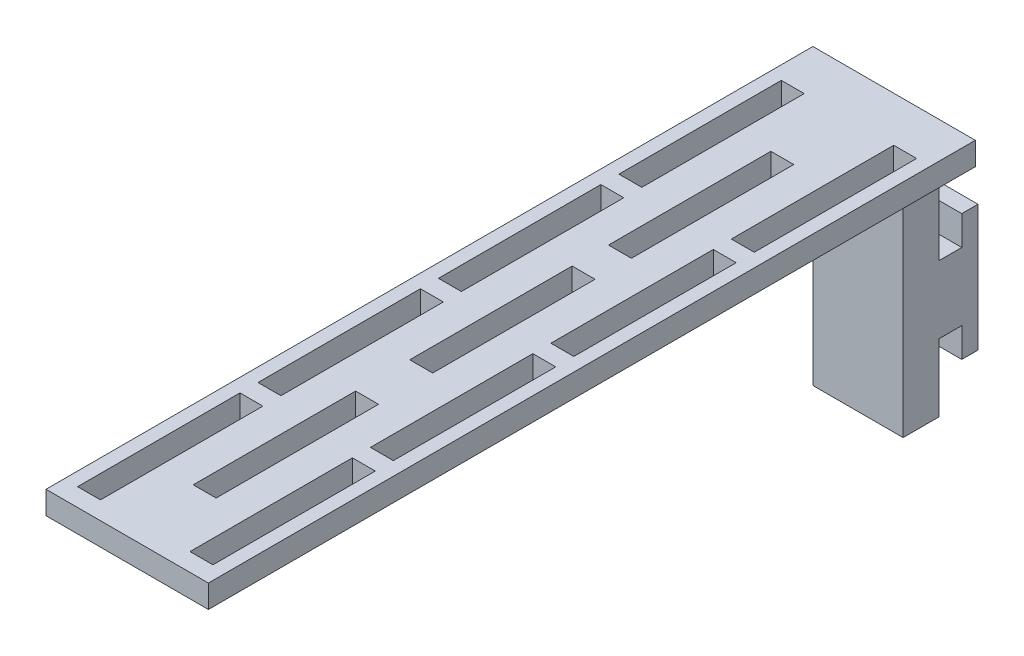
ISO-10303-21;
HEADER;
FILE_DESCRIPTION(('STEP AP214'),'2;1');
FILE_NAME('part.step','',(''),(''),'','','');
FILE_SCHEMA(('AUTOMOTIVE_DESIGN { 1 0 10303 214 1 1 1 1 }'));
ENDSEC;
DATA;
#1=APPLICATION_CONTEXT('core data for automotive mechanical design processes');
#2=APPLICATION_PROTOCOL_DEFINITION('international standard','automotive_design',2000,#1);
#3=PRODUCT_CONTEXT('',#1,'mechanical');
#4=PRODUCT('Part','Part','',(#3));
#5=PRODUCT_RELATED_PRODUCT_CATEGORY('part','',(#4));
#6=PRODUCT_DEFINITION_FORMATION('','',#4);
#7=PRODUCT_DEFINITION_CONTEXT('part definition',#1,'design');
#8=PRODUCT_DEFINITION('design','',#6,#7);
#9=PRODUCT_DEFINITION_SHAPE('','',#8);
#10=(LENGTH_UNIT() NAMED_UNIT(*) SI_UNIT(.MILLI.,.METRE.));
#11=(NAMED_UNIT(*) PLANE_ANGLE_UNIT() SI_UNIT($,.RADIAN.));
#12=(NAMED_UNIT(*) SI_UNIT($,.STERADIAN.) SOLID_ANGLE_UNIT());
#13=UNCERTAINTY_MEASURE_WITH_UNIT(LENGTH_MEASURE(1.E-05),#10,'distance_accuracy_value','');
#14=(GEOMETRIC_REPRESENTATION_CONTEXT(3) GLOBAL_UNCERTAINTY_ASSIGNED_CONTEXT((#13)) GLOBAL_UNIT_ASSIGNED_CONTEXT((#10,
#11,#12)) REPRESENTATION_CONTEXT('',''));
#15=CARTESIAN_POINT('',(0.,0.,0.));
#16=DIRECTION('',(0.,0.,1.));
#17=DIRECTION('',(1.,0.,0.));
#18=AXIS2_PLACEMENT_3D('',#15,#16,#17);
#19=CARTESIAN_POINT('',(15.,-4.25,8.3));
#20=DIRECTION('',(0.,1.,0.));
#21=DIRECTION('',(0.,0.,1.));
#22=AXIS2_PLACEMENT_3D('',#19,#20,#21);
#23=PLANE('',#22);
#24=DIRECTION('',(0.,0.,1.));
#25=VECTOR('',#24,1.);
#26=CARTESIAN_POINT('',(1.99999999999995,-4.25,-8.7));
#27=LINE('',#26,#25);
#28=CARTESIAN_POINT('',(1.99999999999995,-4.25,4.3));
#29=VERTEX_POINT('',#28);
#30=CARTESIAN_POINT('',(1.99999999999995,-4.25,8.3));
#31=VERTEX_POINT('',#30);
#32=EDGE_CURVE('E395',#29,#31,#27,.T.);
#33=ORIENTED_EDGE('',*,*,#32,.F.);
#34=DIRECTION('',(-1.,0.,0.));
#35=VECTOR('',#34,1.);
#36=CARTESIAN_POINT('',(15.,-4.25,4.3));
#37=LINE('',#36,#35);
#38=CARTESIAN_POINT('',(12.,-4.25,4.3));
#39=VERTEX_POINT('',#38);
#40=EDGE_CURVE('E10',#39,#29,#37,.T.);
#41=ORIENTED_EDGE('',*,*,#40,.F.);
#42=DIRECTION('',(0.,0.,-1.));
#43=VECTOR('',#42,1.);
#44=CARTESIAN_POINT('',(12.,-4.25,14.3));
#45=LINE('',#44,#43);
#46=CARTESIAN_POINT('',(12.,-4.25,8.3));
#47=VERTEX_POINT('',#46);
#48=EDGE_CURVE('E420',#47,#39,#45,.T.);
#49=ORIENTED_EDGE('',*,*,#48,.F.);
#50=DIRECTION('',(-1.,0.,0.));
#51=VECTOR('',#50,1.);
#52=CARTESIAN_POINT('',(15.,-4.25,8.3));
#53=LINE('',#52,#51);
#54=EDGE_CURVE('E414',#47,#31,#53,.T.);
#55=ORIENTED_EDGE('',*,*,#54,.T.);
#56=EDGE_LOOP('',(#33,#41,#49,#55));
#57=FACE_BOUND('',#56,.T.);
#58=ADVANCED_FACE('F16',(#57),#23,.F.);
#59=CARTESIAN_POINT('',(15.,21.75,8.3));
#60=DIRECTION('',(0.,0.,-1.));
#61=DIRECTION('',(-1.,0.,0.));
#62=AXIS2_PLACEMENT_3D('',#59,#60,#61);
#63=PLANE('',#62);
#64=DIRECTION('',(0.,1.,0.));
#65=VECTOR('',#64,1.);
#66=CARTESIAN_POINT('',(1.99999999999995,-4.25,8.3));
#67=LINE('',#66,#65);
#68=CARTESIAN_POINT('',(1.99999999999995,21.75,8.3));
#69=VERTEX_POINT('',#68);
#70=EDGE_CURVE('E399',#31,#69,#67,.T.);
#71=ORIENTED_EDGE('',*,*,#70,.F.);
#72=ORIENTED_EDGE('',*,*,#54,.F.);
#73=DIRECTION('',(0.,1.,0.));
#74=VECTOR('',#73,1.);
#75=CARTESIAN_POINT('',(12.,21.75,8.3));
#76=LINE('',#75,#74);
#77=CARTESIAN_POINT('',(12.,21.75,8.3));
#78=VERTEX_POINT('',#77);
#79=EDGE_CURVE('E1039',#47,#78,#76,.T.);
#80=ORIENTED_EDGE('',*,*,#79,.T.);
#81=DIRECTION('',(-1.,0.,0.));
#82=VECTOR('',#81,1.);
#83=CARTESIAN_POINT('',(15.,21.75,8.3));
#84=LINE('',#83,#82);
#85=EDGE_CURVE('E416',#78,#69,#84,.T.);
#86=ORIENTED_EDGE('',*,*,#85,.T.);
#87=EDGE_LOOP('',(#71,#72,#80,#86));
#88=FACE_BOUND('',#87,.T.);
#89=ADVANCED_FACE('F412',(#88),#63,.F.);
#90=CARTESIAN_POINT('',(15.,-4.25,4.3));
#91=DIRECTION('',(0.,0.,1.));
#92=DIRECTION('',(0.,-1.,0.));
#93=AXIS2_PLACEMENT_3D('',#90,#91,#92);
#94=PLANE('',#93);
#95=ORIENTED_EDGE('',*,*,#40,.T.);
#96=DIRECTION('',(0.,1.,0.));
#97=VECTOR('',#96,1.);
#98=CARTESIAN_POINT('',(1.99999999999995,-4.25,4.3));
#99=LINE('',#98,#97);
#100=CARTESIAN_POINT('',(1.99999999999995,3.25,4.3));
#101=VERTEX_POINT('',#100);
#102=EDGE_CURVE('E402',#29,#101,#99,.T.);
#103=ORIENTED_EDGE('',*,*,#102,.T.);
#104=DIRECTION('',(-1.,0.,0.));
#105=VECTOR('',#104,1.);
#106=CARTESIAN_POINT('',(15.,3.25,4.3));
#107=LINE('',#106,#105);
#108=CARTESIAN_POINT('',(12.,3.25,4.3));
#109=VERTEX_POINT('',#108);
#110=EDGE_CURVE('E25',#109,#101,#107,.T.);
#111=ORIENTED_EDGE('',*,*,#110,.F.);
#112=DIRECTION('',(0.,-1.,0.));
#113=VECTOR('',#112,1.);
#114=CARTESIAN_POINT('',(12.,-4.25,4.3));
#115=LINE('',#114,#113);
#116=EDGE_CURVE('E975',#109,#39,#115,.T.);
#117=ORIENTED_EDGE('',*,*,#116,.T.);
#118=EDGE_LOOP('',(#95,#103,#111,#117));
#119=FACE_BOUND('',#118,.T.);
#120=ADVANCED_FACE('F1115',(#119),#94,.F.);
#121=CARTESIAN_POINT('',(15.,3.25,4.3));
#122=DIRECTION('',(0.,1.,0.));
#123=DIRECTION('',(0.,0.,1.));
#124=AXIS2_PLACEMENT_3D('',#121,#122,#123);
#125=PLANE('',#124);
#126=ORIENTED_EDGE('',*,*,#110,.T.);
#127=DIRECTION('',(0.,0.,-1.));
#128=VECTOR('',#127,1.);
#129=CARTESIAN_POINT('',(1.99999999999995,3.25,4.3));
#130=LINE('',#129,#128);
#131=CARTESIAN_POINT('',(1.99999999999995,3.25,1.8));
#132=VERTEX_POINT('',#131);
#133=EDGE_CURVE('E1050',#101,#132,#130,.T.);
#134=ORIENTED_EDGE('',*,*,#133,.T.);
#135=DIRECTION('',(-1.,0.,0.));
#136=VECTOR('',#135,1.);
#137=CARTESIAN_POINT('',(15.,3.25,1.8));
#138=LINE('',#137,#136);
#139=CARTESIAN_POINT('',(12.,3.25,1.8));
#140=VERTEX_POINT('',#139);
#141=EDGE_CURVE('E437',#140,#132,#138,.T.);
#142=ORIENTED_EDGE('',*,*,#141,.F.);
#143=DIRECTION('',(0.,0.,1.));
#144=VECTOR('',#143,1.);
#145=CARTESIAN_POINT('',(12.,3.25,4.3));
#146=LINE('',#145,#144);
#147=EDGE_CURVE('E1007',#140,#109,#146,.T.);
#148=ORIENTED_EDGE('',*,*,#147,.T.);
#149=EDGE_LOOP('',(#126,#134,#142,#148));
#150=FACE_BOUND('',#149,.T.);
#151=ADVANCED_FACE('F1112',(#150),#125,.F.);
#152=CARTESIAN_POINT('',(15.,3.25,1.8));
#153=DIRECTION('',(0.,0.,-1.));
#154=DIRECTION('',(-1.,0.,0.));
#155=AXIS2_PLACEMENT_3D('',#152,#153,#154);
#156=PLANE('',#155);
#157=ORIENTED_EDGE('',*,*,#141,.T.);
#158=DIRECTION('',(0.,-1.,0.));
#159=VECTOR('',#158,1.);
#160=CARTESIAN_POINT('',(1.99999999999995,3.25,1.8));
#161=LINE('',#160,#159);
#162=CARTESIAN_POINT('',(1.99999999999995,0.,1.8));
#163=VERTEX_POINT('',#162);
#164=EDGE_CURVE('E1054',#132,#163,#161,.T.);
#165=ORIENTED_EDGE('',*,*,#164,.T.);
#166=DIRECTION('',(-1.,0.,0.));
#167=VECTOR('',#166,1.);
#168=CARTESIAN_POINT('',(15.,0.,1.8));
#169=LINE('',#168,#167);
#170=CARTESIAN_POINT('',(12.,0.,1.8));
#171=VERTEX_POINT('',#170);
#172=EDGE_CURVE('E441',#171,#163,#169,.T.);
#173=ORIENTED_EDGE('',*,*,#172,.F.);
#174=DIRECTION('',(0.,1.,0.));
#175=VECTOR('',#174,1.);
#176=CARTESIAN_POINT('',(12.,3.25,1.8));
#177=LINE('',#176,#175);
#178=EDGE_CURVE('E1011',#171,#140,#177,.T.);
#179=ORIENTED_EDGE('',*,*,#178,.T.);
#180=EDGE_LOOP('',(#157,#165,#173,#179));
#181=FACE_BOUND('',#180,.T.);
#182=ADVANCED_FACE('F1109',(#181),#156,.F.);
#183=CARTESIAN_POINT('',(15.,0.,1.8));
#184=DIRECTION('',(0.,1.,0.));
#185=DIRECTION('',(0.,0.,1.));
#186=AXIS2_PLACEMENT_3D('',#183,#184,#185);
#187=PLANE('',#186);
#188=ORIENTED_EDGE('',*,*,#172,.T.);
#189=DIRECTION('',(0.,0.,-1.));
#190=VECTOR('',#189,1.);
#191=CARTESIAN_POINT('',(1.99999999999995,0.,1.8));
#192=LINE('',#191,#190);
#193=CARTESIAN_POINT('',(1.99999999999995,0.,0.));
#194=VERTEX_POINT('',#193);
#195=EDGE_CURVE('E1058',#163,#194,#192,.T.);
#196=ORIENTED_EDGE('',*,*,#195,.T.);
#197=DIRECTION('',(-1.,0.,0.));
#198=VECTOR('',#197,1.);
#199=CARTESIAN_POINT('',(15.,0.,0.));
#200=LINE('',#199,#198);
#201=CARTESIAN_POINT('',(12.,0.,0.));
#202=VERTEX_POINT('',#201);
#203=EDGE_CURVE('E445',#202,#194,#200,.T.);
#204=ORIENTED_EDGE('',*,*,#203,.F.);
#205=DIRECTION('',(0.,0.,1.));
#206=VECTOR('',#205,1.);
#207=CARTESIAN_POINT('',(12.,0.,1.8));
#208=LINE('',#207,#206);
#209=EDGE_CURVE('E1015',#202,#171,#208,.T.);
#210=ORIENTED_EDGE('',*,*,#209,.T.);
#211=EDGE_LOOP('',(#188,#196,#204,#210));
#212=FACE_BOUND('',#211,.T.);
#213=ADVANCED_FACE('F1106',(#212),#187,.F.);
#214=CARTESIAN_POINT('',(15.,0.,0.));
#215=DIRECTION('',(0.,0.,1.));
#216=DIRECTION('',(1.,0.,0.));
#217=AXIS2_PLACEMENT_3D('',#214,#215,#216);
#218=PLANE('',#217);
#219=ORIENTED_EDGE('',*,*,#203,.T.);
#220=DIRECTION('',(0.,1.,0.));
#221=VECTOR('',#220,1.);
#222=CARTESIAN_POINT('',(1.99999999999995,0.,0.));
#223=LINE('',#222,#221);
#224=CARTESIAN_POINT('',(1.99999999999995,14.,0.));
#225=VERTEX_POINT('',#224);
#226=EDGE_CURVE('E1062',#194,#225,#223,.T.);
#227=ORIENTED_EDGE('',*,*,#226,.T.);
#228=DIRECTION('',(-1.,0.,0.));
#229=VECTOR('',#228,1.);
#230=CARTESIAN_POINT('',(15.,14.,0.));
#231=LINE('',#230,#229);
#232=CARTESIAN_POINT('',(12.,14.,0.));
#233=VERTEX_POINT('',#232);
#234=EDGE_CURVE('E449',#233,#225,#231,.T.);
#235=ORIENTED_EDGE('',*,*,#234,.F.);
#236=DIRECTION('',(0.,-1.,0.));
#237=VECTOR('',#236,1.);
#238=CARTESIAN_POINT('',(12.,0.,0.));
#239=LINE('',#238,#237);
#240=EDGE_CURVE('E1019',#233,#202,#239,.T.);
#241=ORIENTED_EDGE('',*,*,#240,.T.);
#242=EDGE_LOOP('',(#219,#227,#235,#241));
#243=FACE_BOUND('',#242,.T.);
#244=ADVANCED_FACE('F1103',(#243),#218,.F.);
#245=CARTESIAN_POINT('',(15.,14.,0.));
#246=DIRECTION('',(0.,-1.,0.));
#247=DIRECTION('',(0.,0.,-1.));
#248=AXIS2_PLACEMENT_3D('',#245,#246,#247);
#249=PLANE('',#248);
#250=ORIENTED_EDGE('',*,*,#234,.T.);
#251=DIRECTION('',(0.,0.,1.));
#252=VECTOR('',#251,1.);
#253=CARTESIAN_POINT('',(1.99999999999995,14.,0.));
#254=LINE('',#253,#252);
#255=CARTESIAN_POINT('',(1.99999999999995,14.,1.8));
#256=VERTEX_POINT('',#255);
#257=EDGE_CURVE('E1066',#225,#256,#254,.T.);
#258=ORIENTED_EDGE('',*,*,#257,.T.);
#259=DIRECTION('',(-1.,0.,0.));
#260=VECTOR('',#259,1.);
#261=CARTESIAN_POINT('',(15.,14.,1.8));
#262=LINE('',#261,#260);
#263=CARTESIAN_POINT('',(12.,14.,1.8));
#264=VERTEX_POINT('',#263);
#265=EDGE_CURVE('E453',#264,#256,#262,.T.);
#266=ORIENTED_EDGE('',*,*,#265,.F.);
#267=DIRECTION('',(0.,0.,-1.));
#268=VECTOR('',#267,1.);
#269=CARTESIAN_POINT('',(12.,14.,0.));
#270=LINE('',#269,#268);
#271=EDGE_CURVE('E1023',#264,#233,#270,.T.);
#272=ORIENTED_EDGE('',*,*,#271,.T.);
#273=EDGE_LOOP('',(#250,#258,#266,#272));
#274=FACE_BOUND('',#273,.T.);
#275=ADVANCED_FACE('F1100',(#274),#249,.F.);
#276=CARTESIAN_POINT('',(15.,14.,1.8));
#277=DIRECTION('',(0.,0.,-1.));
#278=DIRECTION('',(0.,1.,0.));
#279=AXIS2_PLACEMENT_3D('',#276,#277,#278);
#280=PLANE('',#279);
#281=ORIENTED_EDGE('',*,*,#265,.T.);
#282=DIRECTION('',(0.,-1.,0.));
#283=VECTOR('',#282,1.);
#284=CARTESIAN_POINT('',(1.99999999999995,14.,1.8));
#285=LINE('',#284,#283);
#286=CARTESIAN_POINT('',(1.99999999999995,10.75,1.8));
#287=VERTEX_POINT('',#286);
#288=EDGE_CURVE('E1070',#256,#287,#285,.T.);
#289=ORIENTED_EDGE('',*,*,#288,.T.);
#290=DIRECTION('',(-1.,0.,0.));
#291=VECTOR('',#290,1.);
#292=CARTESIAN_POINT('',(15.,10.75,1.8));
#293=LINE('',#292,#291);
#294=CARTESIAN_POINT('',(12.,10.75,1.8));
#295=VERTEX_POINT('',#294);
#296=EDGE_CURVE('E457',#295,#287,#293,.T.);
#297=ORIENTED_EDGE('',*,*,#296,.F.);
#298=DIRECTION('',(0.,1.,0.));
#299=VECTOR('',#298,1.);
#300=CARTESIAN_POINT('',(12.,14.,1.8));
#301=LINE('',#300,#299);
#302=EDGE_CURVE('E1027',#295,#264,#301,.T.);
#303=ORIENTED_EDGE('',*,*,#302,.T.);
#304=EDGE_LOOP('',(#281,#289,#297,#303));
#305=FACE_BOUND('',#304,.T.);
#306=ADVANCED_FACE('F1097',(#305),#280,.F.);
#307=CARTESIAN_POINT('',(15.,10.75,1.8));
#308=DIRECTION('',(0.,-1.,0.));
#309=DIRECTION('',(0.,0.,-1.));
#310=AXIS2_PLACEMENT_3D('',#307,#308,#309);
#311=PLANE('',#310);
#312=ORIENTED_EDGE('',*,*,#296,.T.);
#313=DIRECTION('',(0.,0.,1.));
#314=VECTOR('',#313,1.);
#315=CARTESIAN_POINT('',(1.99999999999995,10.75,1.8));
#316=LINE('',#315,#314);
#317=CARTESIAN_POINT('',(1.99999999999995,10.75,4.3));
#318=VERTEX_POINT('',#317);
#319=EDGE_CURVE('E1074',#287,#318,#316,.T.);
#320=ORIENTED_EDGE('',*,*,#319,.T.);
#321=DIRECTION('',(-1.,0.,0.));
#322=VECTOR('',#321,1.);
#323=CARTESIAN_POINT('',(15.,10.75,4.3));
#324=LINE('',#323,#322);
#325=CARTESIAN_POINT('',(12.,10.75,4.3));
#326=VERTEX_POINT('',#325);
#327=EDGE_CURVE('E428',#326,#318,#324,.T.);
#328=ORIENTED_EDGE('',*,*,#327,.F.);
#329=DIRECTION('',(0.,0.,-1.));
#330=VECTOR('',#329,1.);
#331=CARTESIAN_POINT('',(12.,10.75,1.8));
#332=LINE('',#331,#330);
#333=EDGE_CURVE('E1031',#326,#295,#332,.T.);
#334=ORIENTED_EDGE('',*,*,#333,.T.);
#335=EDGE_LOOP('',(#312,#320,#328,#334));
#336=FACE_BOUND('',#335,.T.);
#337=ADVANCED_FACE('F1094',(#336),#311,.F.);
#338=CARTESIAN_POINT('',(15.,10.75,4.3));
#339=DIRECTION('',(0.,0.,1.));
#340=DIRECTION('',(1.,0.,0.));
#341=AXIS2_PLACEMENT_3D('',#338,#339,#340);
#342=PLANE('',#341);
#343=ORIENTED_EDGE('',*,*,#327,.T.);
#344=DIRECTION('',(0.,1.,0.));
#345=VECTOR('',#344,1.);
#346=CARTESIAN_POINT('',(1.99999999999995,10.75,4.3));
#347=LINE('',#346,#345);
#348=CARTESIAN_POINT('',(1.99999999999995,21.75,4.3));
#349=VERTEX_POINT('',#348);
#350=EDGE_CURVE('E407',#318,#349,#347,.T.);
#351=ORIENTED_EDGE('',*,*,#350,.T.);
#352=DIRECTION('',(-1.,0.,0.));
#353=VECTOR('',#352,1.);
#354=CARTESIAN_POINT('',(16.,21.75,4.3));
#355=LINE('',#354,#353);
#356=CARTESIAN_POINT('',(-2.,21.75,4.3));
#357=VERTEX_POINT('',#356);
#358=EDGE_CURVE('E19',#357,#349,#355,.F.);
#359=ORIENTED_EDGE('',*,*,#358,.F.);
#360=DIRECTION('',(0.,-1.,0.));
#361=VECTOR('',#360,1.);
#362=CARTESIAN_POINT('',(-2.,24.29,4.3));
#363=LINE('',#362,#361);
#364=CARTESIAN_POINT('',(-2.,24.29,4.3));
#365=VERTEX_POINT('',#364);
#366=EDGE_CURVE('E464',#365,#357,#363,.T.);
#367=ORIENTED_EDGE('',*,*,#366,.F.);
#368=DIRECTION('',(-1.,0.,0.));
#369=VECTOR('',#368,1.);
#370=CARTESIAN_POINT('',(16.,24.29,4.3));
#371=LINE('',#370,#369);
#372=CARTESIAN_POINT('',(16.,24.29,4.3));
#373=VERTEX_POINT('',#372);
#374=EDGE_CURVE('E468',#373,#365,#371,.T.);
#375=ORIENTED_EDGE('',*,*,#374,.F.);
#376=DIRECTION('',(0.,-1.,0.));
#377=VECTOR('',#376,1.);
#378=CARTESIAN_POINT('',(16.,24.29,4.3));
#379=LINE('',#378,#377);
#380=CARTESIAN_POINT('',(16.,21.75,4.3));
#381=VERTEX_POINT('',#380);
#382=EDGE_CURVE('E467',#373,#381,#379,.T.);
#383=ORIENTED_EDGE('',*,*,#382,.T.);
#384=DIRECTION('',(-1.,0.,0.));
#385=VECTOR('',#384,1.);
#386=CARTESIAN_POINT('',(16.,21.75,4.3));
#387=LINE('',#386,#385);
#388=CARTESIAN_POINT('',(12.,21.75,4.3));
#389=VERTEX_POINT('',#388);
#390=EDGE_CURVE('E476',#389,#381,#387,.F.);
#391=ORIENTED_EDGE('',*,*,#390,.F.);
#392=DIRECTION('',(0.,-1.,0.));
#393=VECTOR('',#392,1.);
#394=CARTESIAN_POINT('',(12.,10.75,4.3));
#395=LINE('',#394,#393);
#396=EDGE_CURVE('E1035',#389,#326,#395,.T.);
#397=ORIENTED_EDGE('',*,*,#396,.T.);
#398=EDGE_LOOP('',(#343,#351,#359,#367,#375,#383,#391,#397));
#399=FACE_BOUND('',#398,.T.);
#400=ADVANCED_FACE('F1089',(#399),#342,.F.);
#401=CARTESIAN_POINT('',(0.,21.75,0.));
#402=DIRECTION('',(0.,1.,0.));
#403=DIRECTION('',(0.,0.,1.));
#404=AXIS2_PLACEMENT_3D('',#401,#402,#403);
#405=PLANE('',#404);
#406=ORIENTED_EDGE('',*,*,#85,.F.);
#407=DIRECTION('',(0.,0.,-1.));
#408=VECTOR('',#407,1.);
#409=CARTESIAN_POINT('',(12.,21.75,14.3));
#410=LINE('',#409,#408);
#411=EDGE_CURVE('E1042',#78,#389,#410,.T.);
#412=ORIENTED_EDGE('',*,*,#411,.T.);
#413=ORIENTED_EDGE('',*,*,#390,.T.);
#414=DIRECTION('',(0.,0.,-1.));
#415=VECTOR('',#414,1.);
#416=CARTESIAN_POINT('',(16.,21.75,89.3));
#417=LINE('',#416,#415);
#418=CARTESIAN_POINT('',(16.,21.75,89.3));
#419=VERTEX_POINT('',#418);
#420=EDGE_CURVE('E481',#419,#381,#417,.T.);
#421=ORIENTED_EDGE('',*,*,#420,.F.);
#422=DIRECTION('',(1.,0.,0.));
#423=VECTOR('',#422,1.);
#424=CARTESIAN_POINT('',(-2.,21.75,89.3));
#425=LINE('',#424,#423);
#426=CARTESIAN_POINT('',(-2.,21.75,89.3));
#427=VERTEX_POINT('',#426);
#428=EDGE_CURVE('E484',#427,#419,#425,.T.);
#429=ORIENTED_EDGE('',*,*,#428,.F.);
#430=DIRECTION('',(0.,0.,1.));
#431=VECTOR('',#430,1.);
#432=CARTESIAN_POINT('',(-2.,21.75,4.3));
#433=LINE('',#432,#431);
#434=EDGE_CURVE('E487',#357,#427,#433,.T.);
#435=ORIENTED_EDGE('',*,*,#434,.F.);
#436=ORIENTED_EDGE('',*,*,#358,.T.);
#437=DIRECTION('',(0.,0.,1.));
#438=VECTOR('',#437,1.);
#439=CARTESIAN_POINT('',(1.99999999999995,21.75,-8.7));
#440=LINE('',#439,#438);
#441=EDGE_CURVE('E408',#349,#69,#440,.T.);
#442=ORIENTED_EDGE('',*,*,#441,.T.);
#443=EDGE_LOOP('',(#406,#412,#413,#421,#429,#435,#436,#442));
#444=FACE_BOUND('',#443,.T.);
#445=DIRECTION('',(-1.,0.,0.));
#446=VECTOR('',#445,1.);
#447=CARTESIAN_POINT('',(0.,21.75,9.3));
#448=LINE('',#447,#446);
#449=CARTESIAN_POINT('',(14.5,21.75,9.3));
#450=VERTEX_POINT('',#449);
#451=CARTESIAN_POINT('',(11.96,21.75,9.3));
#452=VERTEX_POINT('',#451);
#453=EDGE_CURVE('E609',#450,#452,#448,.T.);
#454=ORIENTED_EDGE('',*,*,#453,.T.);
#455=DIRECTION('',(0.,0.,1.));
#456=VECTOR('',#455,1.);
#457=CARTESIAN_POINT('',(11.96,21.75,0.));
#458=LINE('',#457,#456);
#459=CARTESIAN_POINT('',(11.96,21.75,27.3));
#460=VERTEX_POINT('',#459);
#461=EDGE_CURVE('E598',#452,#460,#458,.T.);
#462=ORIENTED_EDGE('',*,*,#461,.T.);
#463=DIRECTION('',(1.,0.,0.));
#464=VECTOR('',#463,1.);
#465=CARTESIAN_POINT('',(0.,21.75,27.3));
#466=LINE('',#465,#464);
#467=CARTESIAN_POINT('',(14.5,21.75,27.3));
#468=VERTEX_POINT('',#467);
#469=EDGE_CURVE('E602',#460,#468,#466,.T.);
#470=ORIENTED_EDGE('',*,*,#469,.T.);
#471=DIRECTION('',(0.,0.,-1.));
#472=VECTOR('',#471,1.);
#473=CARTESIAN_POINT('',(14.5,21.75,0.));
#474=LINE('',#473,#472);
#475=EDGE_CURVE('E606',#468,#450,#474,.T.);
#476=ORIENTED_EDGE('',*,*,#475,.T.);
#477=EDGE_LOOP('',(#454,#462,#470,#476));
#478=FACE_BOUND('',#477,.T.);
#479=DIRECTION('',(-1.,0.,0.));
#480=VECTOR('',#479,1.);
#481=CARTESIAN_POINT('',(0.,21.75,69.3));
#482=LINE('',#481,#480);
#483=CARTESIAN_POINT('',(14.5,21.75,69.3));
#484=VERTEX_POINT('',#483);
#485=CARTESIAN_POINT('',(11.96,21.75,69.3));
#486=VERTEX_POINT('',#485);
#487=EDGE_CURVE('E672',#484,#486,#482,.T.);
#488=ORIENTED_EDGE('',*,*,#487,.T.);
#489=DIRECTION('',(0.,0.,1.));
#490=VECTOR('',#489,1.);
#491=CARTESIAN_POINT('',(11.96,21.75,0.));
#492=LINE('',#491,#490);
#493=CARTESIAN_POINT('',(11.96,21.75,87.3));
#494=VERTEX_POINT('',#493);
#495=EDGE_CURVE('E660',#486,#494,#492,.T.);
#496=ORIENTED_EDGE('',*,*,#495,.T.);
#497=DIRECTION('',(1.,0.,0.));
#498=VECTOR('',#497,1.);
#499=CARTESIAN_POINT('',(0.,21.75,87.3));
#500=LINE('',#499,#498);
#501=CARTESIAN_POINT('',(14.5,21.75,87.3));
#502=VERTEX_POINT('',#501);
#503=EDGE_CURVE('E664',#494,#502,#500,.T.);
#504=ORIENTED_EDGE('',*,*,#503,.T.);
#505=DIRECTION('',(0.,0.,-1.));
#506=VECTOR('',#505,1.);
#507=CARTESIAN_POINT('',(14.5,21.75,0.));
#508=LINE('',#507,#506);
#509=EDGE_CURVE('E668',#502,#484,#508,.T.);
#510=ORIENTED_EDGE('',*,*,#509,.T.);
#511=EDGE_LOOP('',(#488,#496,#504,#510));
#512=FACE_BOUND('',#511,.T.);
#513=DIRECTION('',(-1.,0.,0.));
#514=VECTOR('',#513,1.);
#515=CARTESIAN_POINT('',(0.,21.75,9.3));
#516=LINE('',#515,#514);
#517=CARTESIAN_POINT('',(2.04,21.75,9.3));
#518=VERTEX_POINT('',#517);
#519=CARTESIAN_POINT('',(-0.5,21.75,9.3));
#520=VERTEX_POINT('',#519);
#521=EDGE_CURVE('E656',#518,#520,#516,.T.);
#522=ORIENTED_EDGE('',*,*,#521,.T.);
#523=DIRECTION('',(0.,0.,1.));
#524=VECTOR('',#523,1.);
#525=CARTESIAN_POINT('',(-0.5,21.75,0.));
#526=LINE('',#525,#524);
#527=CARTESIAN_POINT('',(-0.5,21.75,27.3));
#528=VERTEX_POINT('',#527);
#529=EDGE_CURVE('E644',#520,#528,#526,.T.);
#530=ORIENTED_EDGE('',*,*,#529,.T.);
#531=DIRECTION('',(1.,0.,0.));
#532=VECTOR('',#531,1.);
#533=CARTESIAN_POINT('',(0.,21.75,27.3));
#534=LINE('',#533,#532);
#535=CARTESIAN_POINT('',(2.04,21.75,27.3));
#536=VERTEX_POINT('',#535);
#537=EDGE_CURVE('E648',#528,#536,#534,.T.);
#538=ORIENTED_EDGE('',*,*,#537,.T.);
#539=DIRECTION('',(0.,0.,-1.));
#540=VECTOR('',#539,1.);
#541=CARTESIAN_POINT('',(2.04,21.75,0.));
#542=LINE('',#541,#540);
#543=EDGE_CURVE('E652',#536,#518,#542,.T.);
#544=ORIENTED_EDGE('',*,*,#543,.T.);
#545=EDGE_LOOP('',(#522,#530,#538,#544));
#546=FACE_BOUND('',#545,.T.);
#547=DIRECTION('',(-1.,0.,0.));
#548=VECTOR('',#547,1.);
#549=CARTESIAN_POINT('',(0.,21.75,29.3));
#550=LINE('',#549,#548);
#551=CARTESIAN_POINT('',(2.04,21.75,29.3));
#552=VERTEX_POINT('',#551);
#553=CARTESIAN_POINT('',(-0.5,21.75,29.3));
#554=VERTEX_POINT('',#553);
#555=EDGE_CURVE('E640',#552,#554,#550,.T.);
#556=ORIENTED_EDGE('',*,*,#555,.T.);
#557=DIRECTION('',(0.,0.,1.));
#558=VECTOR('',#557,1.);
#559=CARTESIAN_POINT('',(-0.5,21.75,0.));
#560=LINE('',#559,#558);
#561=CARTESIAN_POINT('',(-0.5,21.75,47.3));
#562=VERTEX_POINT('',#561);
#563=EDGE_CURVE('E628',#554,#562,#560,.T.);
#564=ORIENTED_EDGE('',*,*,#563,.T.);
#565=DIRECTION('',(1.,0.,0.));
#566=VECTOR('',#565,1.);
#567=CARTESIAN_POINT('',(0.,21.75,47.3));
#568=LINE('',#567,#566);
#569=CARTESIAN_POINT('',(2.04,21.75,47.3));
#570=VERTEX_POINT('',#569);
#571=EDGE_CURVE('E632',#562,#570,#568,.T.);
#572=ORIENTED_EDGE('',*,*,#571,.T.);
#573=DIRECTION('',(0.,0.,-1.));
#574=VECTOR('',#573,1.);
#575=CARTESIAN_POINT('',(2.04,21.75,0.));
#576=LINE('',#575,#574);
#577=EDGE_CURVE('E636',#570,#552,#576,.T.);
#578=ORIENTED_EDGE('',*,*,#577,.T.);
#579=EDGE_LOOP('',(#556,#564,#572,#578));
#580=FACE_BOUND('',#579,.T.);
#581=DIRECTION('',(-1.,0.,0.));
#582=VECTOR('',#581,1.);
#583=CARTESIAN_POINT('',(0.,21.75,62.7139342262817));
#584=LINE('',#583,#582);
#585=CARTESIAN_POINT('',(8.27,21.75,62.7139342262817));
#586=VERTEX_POINT('',#585);
#587=CARTESIAN_POINT('',(5.73,21.75,62.7139342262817));
#588=VERTEX_POINT('',#587);
#589=EDGE_CURVE('E624',#586,#588,#584,.T.);
#590=ORIENTED_EDGE('',*,*,#589,.T.);
#591=DIRECTION('',(0.,0.,1.));
#592=VECTOR('',#591,1.);
#593=CARTESIAN_POINT('',(5.73,21.75,0.));
#594=LINE('',#593,#592);
#595=CARTESIAN_POINT('',(5.73,21.75,80.7139342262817));
#596=VERTEX_POINT('',#595);
#597=EDGE_CURVE('E612',#588,#596,#594,.T.);
#598=ORIENTED_EDGE('',*,*,#597,.T.);
#599=DIRECTION('',(1.,0.,0.));
#600=VECTOR('',#599,1.);
#601=CARTESIAN_POINT('',(0.,21.75,80.7139342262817));
#602=LINE('',#601,#600);
#603=CARTESIAN_POINT('',(8.27,21.75,80.7139342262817));
#604=VERTEX_POINT('',#603);
#605=EDGE_CURVE('E616',#596,#604,#602,.T.);
#606=ORIENTED_EDGE('',*,*,#605,.T.);
#607=DIRECTION('',(0.,0.,-1.));
#608=VECTOR('',#607,1.);
#609=CARTESIAN_POINT('',(8.27,21.75,0.));
#610=LINE('',#609,#608);
#611=EDGE_CURVE('E620',#604,#586,#610,.T.);
#612=ORIENTED_EDGE('',*,*,#611,.T.);
#613=EDGE_LOOP('',(#590,#598,#606,#612));
#614=FACE_BOUND('',#613,.T.);
#615=DIRECTION('',(-1.,0.,0.));
#616=VECTOR('',#615,1.);
#617=CARTESIAN_POINT('',(0.,21.75,29.3));
#618=LINE('',#617,#616);
#619=CARTESIAN_POINT('',(14.5,21.75,29.3));
#620=VERTEX_POINT('',#619);
#621=CARTESIAN_POINT('',(11.96,21.75,29.3));
#622=VERTEX_POINT('',#621);
#623=EDGE_CURVE('E594',#620,#622,#618,.T.);
#624=ORIENTED_EDGE('',*,*,#623,.T.);
#625=DIRECTION('',(0.,0.,1.));
#626=VECTOR('',#625,1.);
#627=CARTESIAN_POINT('',(11.96,21.75,0.));
#628=LINE('',#627,#626);
#629=CARTESIAN_POINT('',(11.96,21.75,47.3));
#630=VERTEX_POINT('',#629);
#631=EDGE_CURVE('E582',#622,#630,#628,.T.);
#632=ORIENTED_EDGE('',*,*,#631,.T.);
#633=DIRECTION('',(1.,0.,0.));
#634=VECTOR('',#633,1.);
#635=CARTESIAN_POINT('',(0.,21.75,47.3));
#636=LINE('',#635,#634);
#637=CARTESIAN_POINT('',(14.5,21.75,47.3));
#638=VERTEX_POINT('',#637);
#639=EDGE_CURVE('E586',#630,#638,#636,.T.);
#640=ORIENTED_EDGE('',*,*,#639,.T.);
#641=DIRECTION('',(0.,0.,-1.));
#642=VECTOR('',#641,1.);
#643=CARTESIAN_POINT('',(14.5,21.75,0.));
#644=LINE('',#643,#642);
#645=EDGE_CURVE('E590',#638,#620,#644,.T.);
#646=ORIENTED_EDGE('',*,*,#645,.T.);
#647=EDGE_LOOP('',(#624,#632,#640,#646));
#648=FACE_BOUND('',#647,.T.);
#649=DIRECTION('',(-1.,0.,0.));
#650=VECTOR('',#649,1.);
#651=CARTESIAN_POINT('',(0.,21.75,49.3));
#652=LINE('',#651,#650);
#653=CARTESIAN_POINT('',(14.5,21.75,49.3));
#654=VERTEX_POINT('',#653);
#655=CARTESIAN_POINT('',(11.96,21.75,49.3));
#656=VERTEX_POINT('',#655);
#657=EDGE_CURVE('E578',#654,#656,#652,.T.);
#658=ORIENTED_EDGE('',*,*,#657,.T.);
#659=DIRECTION('',(0.,0.,1.));
#660=VECTOR('',#659,1.);
#661=CARTESIAN_POINT('',(11.96,21.75,0.));
#662=LINE('',#661,#660);
#663=CARTESIAN_POINT('',(11.96,21.75,67.3));
#664=VERTEX_POINT('',#663);
#665=EDGE_CURVE('E566',#656,#664,#662,.T.);
#666=ORIENTED_EDGE('',*,*,#665,.T.);
#667=DIRECTION('',(1.,0.,0.));
#668=VECTOR('',#667,1.);
#669=CARTESIAN_POINT('',(0.,21.75,67.3));
#670=LINE('',#669,#668);
#671=CARTESIAN_POINT('',(14.5,21.75,67.3));
#672=VERTEX_POINT('',#671);
#673=EDGE_CURVE('E570',#664,#672,#670,.T.);
#674=ORIENTED_EDGE('',*,*,#673,.T.);
#675=DIRECTION('',(0.,0.,-1.));
#676=VECTOR('',#675,1.);
#677=CARTESIAN_POINT('',(14.5,21.75,0.));
#678=LINE('',#677,#676);
#679=EDGE_CURVE('E574',#672,#654,#678,.T.);
#680=ORIENTED_EDGE('',*,*,#679,.T.);
#681=EDGE_LOOP('',(#658,#666,#674,#680));
#682=FACE_BOUND('',#681,.T.);
#683=DIRECTION('',(-1.,0.,0.));
#684=VECTOR('',#683,1.);
#685=CARTESIAN_POINT('',(0.,21.75,38.7139342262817));
#686=LINE('',#685,#684);
#687=CARTESIAN_POINT('',(8.27,21.75,38.7139342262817));
#688=VERTEX_POINT('',#687);
#689=CARTESIAN_POINT('',(5.73,21.75,38.7139342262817));
#690=VERTEX_POINT('',#689);
#691=EDGE_CURVE('E562',#688,#690,#686,.T.);
#692=ORIENTED_EDGE('',*,*,#691,.T.);
#693=DIRECTION('',(0.,0.,1.));
#694=VECTOR('',#693,1.);
#695=CARTESIAN_POINT('',(5.73,21.75,0.));
#696=LINE('',#695,#694);
#697=CARTESIAN_POINT('',(5.73,21.75,56.7139342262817));
#698=VERTEX_POINT('',#697);
#699=EDGE_CURVE('E550',#690,#698,#696,.T.);
#700=ORIENTED_EDGE('',*,*,#699,.T.);
#701=DIRECTION('',(1.,0.,0.));
#702=VECTOR('',#701,1.);
#703=CARTESIAN_POINT('',(0.,21.75,56.7139342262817));
#704=LINE('',#703,#702);
#705=CARTESIAN_POINT('',(8.27,21.75,56.7139342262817));
#706=VERTEX_POINT('',#705);
#707=EDGE_CURVE('E554',#698,#706,#704,.T.);
#708=ORIENTED_EDGE('',*,*,#707,.T.);
#709=DIRECTION('',(0.,0.,-1.));
#710=VECTOR('',#709,1.);
#711=CARTESIAN_POINT('',(8.27,21.75,0.));
#712=LINE('',#711,#710);
#713=EDGE_CURVE('E558',#706,#688,#712,.T.);
#714=ORIENTED_EDGE('',*,*,#713,.T.);
#715=EDGE_LOOP('',(#692,#700,#708,#714));
#716=FACE_BOUND('',#715,.T.);
#717=DIRECTION('',(-1.,0.,0.));
#718=VECTOR('',#717,1.);
#719=CARTESIAN_POINT('',(0.,21.75,16.6863206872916));
#720=LINE('',#719,#718);
#721=CARTESIAN_POINT('',(8.27,21.75,16.6863206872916));
#722=VERTEX_POINT('',#721);
#723=CARTESIAN_POINT('',(5.73,21.75,16.6863206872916));
#724=VERTEX_POINT('',#723);
#725=EDGE_CURVE('E546',#722,#724,#720,.T.);
#726=ORIENTED_EDGE('',*,*,#725,.T.);
#727=DIRECTION('',(0.,0.,1.));
#728=VECTOR('',#727,1.);
#729=CARTESIAN_POINT('',(5.73,21.75,0.));
#730=LINE('',#729,#728);
#731=CARTESIAN_POINT('',(5.73,21.75,34.6863206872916));
#732=VERTEX_POINT('',#731);
#733=EDGE_CURVE('E534',#724,#732,#730,.T.);
#734=ORIENTED_EDGE('',*,*,#733,.T.);
#735=DIRECTION('',(1.,0.,0.));
#736=VECTOR('',#735,1.);
#737=CARTESIAN_POINT('',(0.,21.75,34.6863206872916));
#738=LINE('',#737,#736);
#739=CARTESIAN_POINT('',(8.27,21.75,34.6863206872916));
#740=VERTEX_POINT('',#739);
#741=EDGE_CURVE('E538',#732,#740,#738,.T.);
#742=ORIENTED_EDGE('',*,*,#741,.T.);
#743=DIRECTION('',(0.,0.,-1.));
#744=VECTOR('',#743,1.);
#745=CARTESIAN_POINT('',(8.27,21.75,0.));
#746=LINE('',#745,#744);
#747=EDGE_CURVE('E542',#740,#722,#746,.T.);
#748=ORIENTED_EDGE('',*,*,#747,.T.);
#749=EDGE_LOOP('',(#726,#734,#742,#748));
#750=FACE_BOUND('',#749,.T.);
#751=DIRECTION('',(-1.,0.,0.));
#752=VECTOR('',#751,1.);
#753=CARTESIAN_POINT('',(0.,21.75,69.3));
#754=LINE('',#753,#752);
#755=CARTESIAN_POINT('',(2.04,21.75,69.3));
#756=VERTEX_POINT('',#755);
#757=CARTESIAN_POINT('',(-0.5,21.75,69.3));
#758=VERTEX_POINT('',#757);
#759=EDGE_CURVE('E530',#756,#758,#754,.T.);
#760=ORIENTED_EDGE('',*,*,#759,.T.);
#761=DIRECTION('',(0.,0.,1.));
#762=VECTOR('',#761,1.);
#763=CARTESIAN_POINT('',(-0.5,21.75,0.));
#764=LINE('',#763,#762);
#765=CARTESIAN_POINT('',(-0.5,21.75,87.3));
#766=VERTEX_POINT('',#765);
#767=EDGE_CURVE('E518',#758,#766,#764,.T.);
#768=ORIENTED_EDGE('',*,*,#767,.T.);
#769=DIRECTION('',(1.,0.,0.));
#770=VECTOR('',#769,1.);
#771=CARTESIAN_POINT('',(0.,21.75,87.3));
#772=LINE('',#771,#770);
#773=CARTESIAN_POINT('',(2.04,21.75,87.3));
#774=VERTEX_POINT('',#773);
#775=EDGE_CURVE('E522',#766,#774,#772,.T.);
#776=ORIENTED_EDGE('',*,*,#775,.T.);
#777=DIRECTION('',(0.,0.,-1.));
#778=VECTOR('',#777,1.);
#779=CARTESIAN_POINT('',(2.04,21.75,0.));
#780=LINE('',#779,#778);
#781=EDGE_CURVE('E526',#774,#756,#780,.T.);
#782=ORIENTED_EDGE('',*,*,#781,.T.);
#783=EDGE_LOOP('',(#760,#768,#776,#782));
#784=FACE_BOUND('',#783,.T.);
#785=DIRECTION('',(-1.,0.,0.));
#786=VECTOR('',#785,1.);
#787=CARTESIAN_POINT('',(0.,21.75,49.3));
#788=LINE('',#787,#786);
#789=CARTESIAN_POINT('',(2.04,21.75,49.3));
#790=VERTEX_POINT('',#789);
#791=CARTESIAN_POINT('',(-0.5,21.75,49.3));
#792=VERTEX_POINT('',#791);
#793=EDGE_CURVE('E514',#790,#792,#788,.T.);
#794=ORIENTED_EDGE('',*,*,#793,.T.);
#795=DIRECTION('',(0.,0.,1.));
#796=VECTOR('',#795,1.);
#797=CARTESIAN_POINT('',(-0.5,21.75,0.));
#798=LINE('',#797,#796);
#799=CARTESIAN_POINT('',(-0.5,21.75,67.3));
#800=VERTEX_POINT('',#799);
#801=EDGE_CURVE('E491',#792,#800,#798,.T.);
#802=ORIENTED_EDGE('',*,*,#801,.T.);
#803=DIRECTION('',(1.,0.,0.));
#804=VECTOR('',#803,1.);
#805=CARTESIAN_POINT('',(0.,21.75,67.3));
#806=LINE('',#805,#804);
#807=CARTESIAN_POINT('',(2.04,21.75,67.3));
#808=VERTEX_POINT('',#807);
#809=EDGE_CURVE('E506',#800,#808,#806,.T.);
#810=ORIENTED_EDGE('',*,*,#809,.T.);
#811=DIRECTION('',(0.,0.,-1.));
#812=VECTOR('',#811,1.);
#813=CARTESIAN_POINT('',(2.04,21.75,0.));
#814=LINE('',#813,#812);
#815=EDGE_CURVE('E510',#808,#790,#814,.T.);
#816=ORIENTED_EDGE('',*,*,#815,.T.);
#817=EDGE_LOOP('',(#794,#802,#810,#816));
#818=FACE_BOUND('',#817,.T.);
#819=ADVANCED_FACE('F1085',(#444,#478,#512,#546,#580,#614,#648,#682,#716,#750,#784,#818),#405,.F.);
#820=CARTESIAN_POINT('',(-2.,24.29,4.3));
#821=DIRECTION('',(1.,0.,0.));
#822=DIRECTION('',(0.,0.,-1.));
#823=AXIS2_PLACEMENT_3D('',#820,#821,#822);
#824=PLANE('',#823);
#825=ORIENTED_EDGE('',*,*,#434,.T.);
#826=DIRECTION('',(0.,-1.,0.));
#827=VECTOR('',#826,1.);
#828=CARTESIAN_POINT('',(-2.,24.29,89.3));
#829=LINE('',#828,#827);
#830=CARTESIAN_POINT('',(-2.,24.29,89.3));
#831=VERTEX_POINT('',#830);
#832=EDGE_CURVE('E422',#831,#427,#829,.T.);
#833=ORIENTED_EDGE('',*,*,#832,.F.);
#834=DIRECTION('',(0.,0.,1.));
#835=VECTOR('',#834,1.);
#836=CARTESIAN_POINT('',(-2.,24.29,4.3));
#837=LINE('',#836,#835);
#838=EDGE_CURVE('E480',#365,#831,#837,.T.);
#839=ORIENTED_EDGE('',*,*,#838,.F.);
#840=ORIENTED_EDGE('',*,*,#366,.T.);
#841=EDGE_LOOP('',(#825,#833,#839,#840));
#842=FACE_BOUND('',#841,.T.);
#843=ADVANCED_FACE('F1129',(#842),#824,.F.);
#844=CARTESIAN_POINT('',(-2.,24.29,89.3));
#845=DIRECTION('',(0.,0.,-1.));
#846=DIRECTION('',(-1.,0.,0.));
#847=AXIS2_PLACEMENT_3D('',#844,#845,#846);
#848=PLANE('',#847);
#849=ORIENTED_EDGE('',*,*,#428,.T.);
#850=DIRECTION('',(0.,-1.,0.));
#851=VECTOR('',#850,1.);
#852=CARTESIAN_POINT('',(16.,24.29,89.3));
#853=LINE('',#852,#851);
#854=CARTESIAN_POINT('',(16.,24.29,89.3));
#855=VERTEX_POINT('',#854);
#856=EDGE_CURVE('E431',#855,#419,#853,.T.);
#857=ORIENTED_EDGE('',*,*,#856,.F.);
#858=DIRECTION('',(1.,0.,0.));
#859=VECTOR('',#858,1.);
#860=CARTESIAN_POINT('',(-2.,24.29,89.3));
#861=LINE('',#860,#859);
#862=EDGE_CURVE('E497',#831,#855,#861,.T.);
#863=ORIENTED_EDGE('',*,*,#862,.F.);
#864=ORIENTED_EDGE('',*,*,#832,.T.);
#865=EDGE_LOOP('',(#849,#857,#863,#864));
#866=FACE_BOUND('',#865,.T.);
#867=ADVANCED_FACE('F1126',(#866),#848,.F.);
#868=CARTESIAN_POINT('',(16.,24.29,89.3));
#869=DIRECTION('',(-1.,0.,0.));
#870=DIRECTION('',(0.,0.,1.));
#871=AXIS2_PLACEMENT_3D('',#868,#869,#870);
#872=PLANE('',#871);
#873=ORIENTED_EDGE('',*,*,#420,.T.);
#874=ORIENTED_EDGE('',*,*,#382,.F.);
#875=DIRECTION('',(0.,0.,-1.));
#876=VECTOR('',#875,1.);
#877=CARTESIAN_POINT('',(16.,24.29,89.3));
#878=LINE('',#877,#876);
#879=EDGE_CURVE('E494',#855,#373,#878,.T.);
#880=ORIENTED_EDGE('',*,*,#879,.F.);
#881=ORIENTED_EDGE('',*,*,#856,.T.);
#882=EDGE_LOOP('',(#873,#874,#880,#881));
#883=FACE_BOUND('',#882,.T.);
#884=ADVANCED_FACE('F1123',(#883),#872,.F.);
#885=CARTESIAN_POINT('',(0.,24.29,0.));
#886=DIRECTION('',(0.,1.,0.));
#887=DIRECTION('',(0.,0.,1.));
#888=AXIS2_PLACEMENT_3D('',#885,#886,#887);
#889=PLANE('',#888);
#890=DIRECTION('',(0.,0.,1.));
#891=VECTOR('',#890,1.);
#892=CARTESIAN_POINT('',(-0.5,24.29,49.3));
#893=LINE('',#892,#891);
#894=CARTESIAN_POINT('',(-0.5,24.29,49.3));
#895=VERTEX_POINT('',#894);
#896=CARTESIAN_POINT('',(-0.5,24.29,67.3));
#897=VERTEX_POINT('',#896);
#898=EDGE_CURVE('E853',#895,#897,#893,.T.);
#899=ORIENTED_EDGE('',*,*,#898,.F.);
#900=DIRECTION('',(-1.,0.,0.));
#901=VECTOR('',#900,1.);
#902=CARTESIAN_POINT('',(2.04,24.29,49.3));
#903=LINE('',#902,#901);
#904=CARTESIAN_POINT('',(2.04,24.29,49.3));
#905=VERTEX_POINT('',#904);
#906=EDGE_CURVE('E831',#905,#895,#903,.T.);
#907=ORIENTED_EDGE('',*,*,#906,.F.);
#908=DIRECTION('',(0.,0.,-1.));
#909=VECTOR('',#908,1.);
#910=CARTESIAN_POINT('',(2.04,24.29,67.3));
#911=LINE('',#910,#909);
#912=CARTESIAN_POINT('',(2.04,24.29,67.3));
#913=VERTEX_POINT('',#912);
#914=EDGE_CURVE('E846',#913,#905,#911,.T.);
#915=ORIENTED_EDGE('',*,*,#914,.F.);
#916=DIRECTION('',(1.,0.,0.));
#917=VECTOR('',#916,1.);
#918=CARTESIAN_POINT('',(-0.5,24.29,67.3));
#919=LINE('',#918,#917);
#920=EDGE_CURVE('E849',#897,#913,#919,.T.);
#921=ORIENTED_EDGE('',*,*,#920,.F.);
#922=EDGE_LOOP('',(#899,#907,#915,#921));
#923=FACE_BOUND('',#922,.T.);
#924=DIRECTION('',(0.,0.,1.));
#925=VECTOR('',#924,1.);
#926=CARTESIAN_POINT('',(-0.5,24.29,69.3));
#927=LINE('',#926,#925);
#928=CARTESIAN_POINT('',(-0.5,24.29,69.3));
#929=VERTEX_POINT('',#928);
#930=CARTESIAN_POINT('',(-0.5,24.29,87.3));
#931=VERTEX_POINT('',#930);
#932=EDGE_CURVE('E836',#929,#931,#927,.T.);
#933=ORIENTED_EDGE('',*,*,#932,.F.);
#934=DIRECTION('',(-1.,0.,0.));
#935=VECTOR('',#934,1.);
#936=CARTESIAN_POINT('',(2.04,24.29,69.3));
#937=LINE('',#936,#935);
#938=CARTESIAN_POINT('',(2.04,24.29,69.3));
#939=VERTEX_POINT('',#938);
#940=EDGE_CURVE('E861',#939,#929,#937,.T.);
#941=ORIENTED_EDGE('',*,*,#940,.F.);
#942=DIRECTION('',(0.,0.,-1.));
#943=VECTOR('',#942,1.);
#944=CARTESIAN_POINT('',(2.04,24.29,87.3));
#945=LINE('',#944,#943);
#946=CARTESIAN_POINT('',(2.04,24.29,87.3));
#947=VERTEX_POINT('',#946);
#948=EDGE_CURVE('E876',#947,#939,#945,.T.);
#949=ORIENTED_EDGE('',*,*,#948,.F.);
#950=DIRECTION('',(1.,0.,0.));
#951=VECTOR('',#950,1.);
#952=CARTESIAN_POINT('',(-0.5,24.29,87.3));
#953=LINE('',#952,#951);
#954=EDGE_CURVE('E879',#931,#947,#953,.T.);
#955=ORIENTED_EDGE('',*,*,#954,.F.);
#956=EDGE_LOOP('',(#933,#941,#949,#955));
#957=FACE_BOUND('',#956,.T.);
#958=DIRECTION('',(0.,0.,1.));
#959=VECTOR('',#958,1.);
#960=CARTESIAN_POINT('',(5.73,24.29,16.6863206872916));
#961=LINE('',#960,#959);
#962=CARTESIAN_POINT('',(5.73,24.29,16.6863206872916));
#963=VERTEX_POINT('',#962);
#964=CARTESIAN_POINT('',(5.73,24.29,34.6863206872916));
#965=VERTEX_POINT('',#964);
#966=EDGE_CURVE('E866',#963,#965,#961,.T.);
#967=ORIENTED_EDGE('',*,*,#966,.F.);
#968=DIRECTION('',(-1.,0.,0.));
#969=VECTOR('',#968,1.);
#970=CARTESIAN_POINT('',(8.27,24.29,16.6863206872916));
#971=LINE('',#970,#969);
#972=CARTESIAN_POINT('',(8.27,24.29,16.6863206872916));
#973=VERTEX_POINT('',#972);
#974=EDGE_CURVE('E890',#973,#963,#971,.T.);
#975=ORIENTED_EDGE('',*,*,#974,.F.);
#976=DIRECTION('',(0.,0.,-1.));
#977=VECTOR('',#976,1.);
#978=CARTESIAN_POINT('',(8.27,24.29,34.6863206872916));
#979=LINE('',#978,#977);
#980=CARTESIAN_POINT('',(8.27,24.29,34.6863206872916));
#981=VERTEX_POINT('',#980);
#982=EDGE_CURVE('E906',#981,#973,#979,.T.);
#983=ORIENTED_EDGE('',*,*,#982,.F.);
#984=DIRECTION('',(1.,0.,0.));
#985=VECTOR('',#984,1.);
#986=CARTESIAN_POINT('',(5.73,24.29,34.6863206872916));
#987=LINE('',#986,#985);
#988=EDGE_CURVE('E909',#965,#981,#987,.T.);
#989=ORIENTED_EDGE('',*,*,#988,.F.);
#990=EDGE_LOOP('',(#967,#975,#983,#989));
#991=FACE_BOUND('',#990,.T.);
#992=DIRECTION('',(0.,0.,1.));
#993=VECTOR('',#992,1.);
#994=CARTESIAN_POINT('',(5.73,24.29,38.7139342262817));
#995=LINE('',#994,#993);
#996=CARTESIAN_POINT('',(5.73,24.29,38.7139342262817));
#997=VERTEX_POINT('',#996);
#998=CARTESIAN_POINT('',(5.73,24.29,56.7139342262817));
#999=VERTEX_POINT('',#998);
#1000=EDGE_CURVE('E895',#997,#999,#995,.T.);
#1001=ORIENTED_EDGE('',*,*,#1000,.F.);
#1002=DIRECTION('',(-1.,0.,0.));
#1003=VECTOR('',#1002,1.);
#1004=CARTESIAN_POINT('',(8.27,24.29,38.7139342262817));
#1005=LINE('',#1004,#1003);
#1006=CARTESIAN_POINT('',(8.27,24.29,38.7139342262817));
#1007=VERTEX_POINT('',#1006);
#1008=EDGE_CURVE('E920',#1007,#997,#1005,.T.);
#1009=ORIENTED_EDGE('',*,*,#1008,.F.);
#1010=DIRECTION('',(0.,0.,-1.));
#1011=VECTOR('',#1010,1.);
#1012=CARTESIAN_POINT('',(8.27,24.29,56.7139342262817));
#1013=LINE('',#1012,#1011);
#1014=CARTESIAN_POINT('',(8.27,24.29,56.7139342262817));
#1015=VERTEX_POINT('',#1014);
#1016=EDGE_CURVE('E934',#1015,#1007,#1013,.T.);
#1017=ORIENTED_EDGE('',*,*,#1016,.F.);
#1018=DIRECTION('',(1.,0.,0.));
#1019=VECTOR('',#1018,1.);
#1020=CARTESIAN_POINT('',(5.73,24.29,56.7139342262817));
#1021=LINE('',#1020,#1019);
#1022=EDGE_CURVE('E937',#999,#1015,#1021,.T.);
#1023=ORIENTED_EDGE('',*,*,#1022,.F.);
#1024=EDGE_LOOP('',(#1001,#1009,#1017,#1023));
#1025=FACE_BOUND('',#1024,.T.);
#1026=DIRECTION('',(0.,0.,1.));
#1027=VECTOR('',#1026,1.);
#1028=CARTESIAN_POINT('',(11.96,24.29,49.3));
#1029=LINE('',#1028,#1027);
#1030=CARTESIAN_POINT('',(11.96,24.29,49.3));
#1031=VERTEX_POINT('',#1030);
#1032=CARTESIAN_POINT('',(11.96,24.29,67.3));
#1033=VERTEX_POINT('',#1032);
#1034=EDGE_CURVE('E716',#1031,#1033,#1029,.T.);
#1035=ORIENTED_EDGE('',*,*,#1034,.F.);
#1036=DIRECTION('',(-1.,0.,0.));
#1037=VECTOR('',#1036,1.);
#1038=CARTESIAN_POINT('',(14.5,24.29,49.3));
#1039=LINE('',#1038,#1037);
#1040=CARTESIAN_POINT('',(14.5,24.29,49.3));
#1041=VERTEX_POINT('',#1040);
#1042=EDGE_CURVE('E743',#1041,#1031,#1039,.T.);
#1043=ORIENTED_EDGE('',*,*,#1042,.F.);
#1044=DIRECTION('',(0.,0.,-1.));
#1045=VECTOR('',#1044,1.);
#1046=CARTESIAN_POINT('',(14.5,24.29,67.3));
#1047=LINE('',#1046,#1045);
#1048=CARTESIAN_POINT('',(14.5,24.29,67.3));
#1049=VERTEX_POINT('',#1048);
#1050=EDGE_CURVE('E757',#1049,#1041,#1047,.T.);
#1051=ORIENTED_EDGE('',*,*,#1050,.F.);
#1052=DIRECTION('',(1.,0.,0.));
#1053=VECTOR('',#1052,1.);
#1054=CARTESIAN_POINT('',(11.96,24.29,67.3));
#1055=LINE('',#1054,#1053);
#1056=EDGE_CURVE('E760',#1033,#1049,#1055,.T.);
#1057=ORIENTED_EDGE('',*,*,#1056,.F.);
#1058=EDGE_LOOP('',(#1035,#1043,#1051,#1057));
#1059=FACE_BOUND('',#1058,.T.);
#1060=DIRECTION('',(0.,0.,1.));
#1061=VECTOR('',#1060,1.);
#1062=CARTESIAN_POINT('',(11.96,24.29,29.3));
#1063=LINE('',#1062,#1061);
#1064=CARTESIAN_POINT('',(11.96,24.29,29.3));
#1065=VERTEX_POINT('',#1064);
#1066=CARTESIAN_POINT('',(11.96,24.29,47.3));
#1067=VERTEX_POINT('',#1066);
#1068=EDGE_CURVE('E734',#1065,#1067,#1063,.T.);
#1069=ORIENTED_EDGE('',*,*,#1068,.F.);
#1070=DIRECTION('',(-1.,0.,0.));
#1071=VECTOR('',#1070,1.);
#1072=CARTESIAN_POINT('',(14.5,24.29,29.3));
#1073=LINE('',#1072,#1071);
#1074=CARTESIAN_POINT('',(14.5,24.29,29.3));
#1075=VERTEX_POINT('',#1074);
#1076=EDGE_CURVE('E711',#1075,#1065,#1073,.T.);
#1077=ORIENTED_EDGE('',*,*,#1076,.F.);
#1078=DIRECTION('',(0.,0.,-1.));
#1079=VECTOR('',#1078,1.);
#1080=CARTESIAN_POINT('',(14.5,24.29,47.3));
#1081=LINE('',#1080,#1079);
#1082=CARTESIAN_POINT('',(14.5,24.29,47.3));
#1083=VERTEX_POINT('',#1082);
#1084=EDGE_CURVE('E727',#1083,#1075,#1081,.T.);
#1085=ORIENTED_EDGE('',*,*,#1084,.F.);
#1086=DIRECTION('',(1.,0.,0.));
#1087=VECTOR('',#1086,1.);
#1088=CARTESIAN_POINT('',(11.96,24.29,47.3));
#1089=LINE('',#1088,#1087);
#1090=EDGE_CURVE('E730',#1067,#1083,#1089,.T.);
#1091=ORIENTED_EDGE('',*,*,#1090,.F.);
#1092=EDGE_LOOP('',(#1069,#1077,#1085,#1091));
#1093=FACE_BOUND('',#1092,.T.);
#1094=DIRECTION('',(0.,0.,1.));
#1095=VECTOR('',#1094,1.);
#1096=CARTESIAN_POINT('',(11.96,24.29,9.3));
#1097=LINE('',#1096,#1095);
#1098=CARTESIAN_POINT('',(11.96,24.29,9.3));
#1099=VERTEX_POINT('',#1098);
#1100=CARTESIAN_POINT('',(11.96,24.29,27.3));
#1101=VERTEX_POINT('',#1100);
#1102=EDGE_CURVE('E776',#1099,#1101,#1097,.T.);
#1103=ORIENTED_EDGE('',*,*,#1102,.F.);
#1104=DIRECTION('',(-1.,0.,0.));
#1105=VECTOR('',#1104,1.);
#1106=CARTESIAN_POINT('',(14.5,24.29,9.3));
#1107=LINE('',#1106,#1105);
#1108=CARTESIAN_POINT('',(14.5,24.29,9.3));
#1109=VERTEX_POINT('',#1108);
#1110=EDGE_CURVE('E804',#1109,#1099,#1107,.T.);
#1111=ORIENTED_EDGE('',*,*,#1110,.F.);
#1112=DIRECTION('',(0.,0.,-1.));
#1113=VECTOR('',#1112,1.);
#1114=CARTESIAN_POINT('',(14.5,24.29,27.3));
#1115=LINE('',#1114,#1113);
#1116=CARTESIAN_POINT('',(14.5,24.29,27.3));
#1117=VERTEX_POINT('',#1116);
#1118=EDGE_CURVE('E818',#1117,#1109,#1115,.T.);
#1119=ORIENTED_EDGE('',*,*,#1118,.F.);
#1120=DIRECTION('',(1.,0.,0.));
#1121=VECTOR('',#1120,1.);
#1122=CARTESIAN_POINT('',(11.96,24.29,27.3));
#1123=LINE('',#1122,#1121);
#1124=EDGE_CURVE('E821',#1101,#1117,#1123,.T.);
#1125=ORIENTED_EDGE('',*,*,#1124,.F.);
#1126=EDGE_LOOP('',(#1103,#1111,#1119,#1125));
#1127=FACE_BOUND('',#1126,.T.);
#1128=DIRECTION('',(0.,0.,1.));
#1129=VECTOR('',#1128,1.);
#1130=CARTESIAN_POINT('',(5.73,24.29,62.7139342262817));
#1131=LINE('',#1130,#1129);
#1132=CARTESIAN_POINT('',(5.73,24.29,62.7139342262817));
#1133=VERTEX_POINT('',#1132);
#1134=CARTESIAN_POINT('',(5.73,24.29,80.7139342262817));
#1135=VERTEX_POINT('',#1134);
#1136=EDGE_CURVE('E794',#1133,#1135,#1131,.T.);
#1137=ORIENTED_EDGE('',*,*,#1136,.F.);
#1138=DIRECTION('',(-1.,0.,0.));
#1139=VECTOR('',#1138,1.);
#1140=CARTESIAN_POINT('',(8.27,24.29,62.7139342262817));
#1141=LINE('',#1140,#1139);
#1142=CARTESIAN_POINT('',(8.27,24.29,62.7139342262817));
#1143=VERTEX_POINT('',#1142);
#1144=EDGE_CURVE('E771',#1143,#1133,#1141,.T.);
#1145=ORIENTED_EDGE('',*,*,#1144,.F.);
#1146=DIRECTION('',(0.,0.,-1.));
#1147=VECTOR('',#1146,1.);
#1148=CARTESIAN_POINT('',(8.27,24.29,80.7139342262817));
#1149=LINE('',#1148,#1147);
#1150=CARTESIAN_POINT('',(8.27,24.29,80.7139342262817));
#1151=VERTEX_POINT('',#1150);
#1152=EDGE_CURVE('E787',#1151,#1143,#1149,.T.);
#1153=ORIENTED_EDGE('',*,*,#1152,.F.);
#1154=DIRECTION('',(1.,0.,0.));
#1155=VECTOR('',#1154,1.);
#1156=CARTESIAN_POINT('',(5.73,24.29,80.7139342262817));
#1157=LINE('',#1156,#1155);
#1158=EDGE_CURVE('E790',#1135,#1151,#1157,.T.);
#1159=ORIENTED_EDGE('',*,*,#1158,.F.);
#1160=EDGE_LOOP('',(#1137,#1145,#1153,#1159));
#1161=FACE_BOUND('',#1160,.T.);
#1162=DIRECTION('',(0.,0.,1.));
#1163=VECTOR('',#1162,1.);
#1164=CARTESIAN_POINT('',(-0.5,24.29,29.3));
#1165=LINE('',#1164,#1163);
#1166=CARTESIAN_POINT('',(-0.5,24.29,29.3));
#1167=VERTEX_POINT('',#1166);
#1168=CARTESIAN_POINT('',(-0.5,24.29,47.3));
#1169=VERTEX_POINT('',#1168);
#1170=EDGE_CURVE('E953',#1167,#1169,#1165,.T.);
#1171=ORIENTED_EDGE('',*,*,#1170,.F.);
#1172=DIRECTION('',(-1.,0.,0.));
#1173=VECTOR('',#1172,1.);
#1174=CARTESIAN_POINT('',(2.04,24.29,29.3));
#1175=LINE('',#1174,#1173);
#1176=CARTESIAN_POINT('',(2.04,24.29,29.3));
#1177=VERTEX_POINT('',#1176);
#1178=EDGE_CURVE('E980',#1177,#1167,#1175,.T.);
#1179=ORIENTED_EDGE('',*,*,#1178,.F.);
#1180=DIRECTION('',(0.,0.,-1.));
#1181=VECTOR('',#1180,1.);
#1182=CARTESIAN_POINT('',(2.04,24.29,47.3));
#1183=LINE('',#1182,#1181);
#1184=CARTESIAN_POINT('',(2.04,24.29,47.3));
#1185=VERTEX_POINT('',#1184);
#1186=EDGE_CURVE('E994',#1185,#1177,#1183,.T.);
#1187=ORIENTED_EDGE('',*,*,#1186,.F.);
#1188=DIRECTION('',(1.,0.,0.));
#1189=VECTOR('',#1188,1.);
#1190=CARTESIAN_POINT('',(-0.5,24.29,47.3));
#1191=LINE('',#1190,#1189);
#1192=EDGE_CURVE('E997',#1169,#1185,#1191,.T.);
#1193=ORIENTED_EDGE('',*,*,#1192,.F.);
#1194=EDGE_LOOP('',(#1171,#1179,#1187,#1193));
#1195=FACE_BOUND('',#1194,.T.);
#1196=DIRECTION('',(0.,0.,1.));
#1197=VECTOR('',#1196,1.);
#1198=CARTESIAN_POINT('',(-0.5,24.29,9.3));
#1199=LINE('',#1198,#1197);
#1200=CARTESIAN_POINT('',(-0.5,24.29,9.3));
#1201=VERTEX_POINT('',#1200);
#1202=CARTESIAN_POINT('',(-0.5,24.29,27.3));
#1203=VERTEX_POINT('',#1202);
#1204=EDGE_CURVE('E971',#1201,#1203,#1199,.T.);
#1205=ORIENTED_EDGE('',*,*,#1204,.F.);
#1206=DIRECTION('',(-1.,0.,0.));
#1207=VECTOR('',#1206,1.);
#1208=CARTESIAN_POINT('',(2.04,24.29,9.3));
#1209=LINE('',#1208,#1207);
#1210=CARTESIAN_POINT('',(2.04,24.29,9.3));
#1211=VERTEX_POINT('',#1210);
#1212=EDGE_CURVE('E948',#1211,#1201,#1209,.T.);
#1213=ORIENTED_EDGE('',*,*,#1212,.F.);
#1214=DIRECTION('',(0.,0.,-1.));
#1215=VECTOR('',#1214,1.);
#1216=CARTESIAN_POINT('',(2.04,24.29,27.3));
#1217=LINE('',#1216,#1215);
#1218=CARTESIAN_POINT('',(2.04,24.29,27.3));
#1219=VERTEX_POINT('',#1218);
#1220=EDGE_CURVE('E964',#1219,#1211,#1217,.T.);
#1221=ORIENTED_EDGE('',*,*,#1220,.F.);
#1222=DIRECTION('',(1.,0.,0.));
#1223=VECTOR('',#1222,1.);
#1224=CARTESIAN_POINT('',(-0.5,24.29,27.3));
#1225=LINE('',#1224,#1223);
#1226=EDGE_CURVE('E967',#1203,#1219,#1225,.T.);
#1227=ORIENTED_EDGE('',*,*,#1226,.F.);
#1228=EDGE_LOOP('',(#1205,#1213,#1221,#1227));
#1229=FACE_BOUND('',#1228,.T.);
#1230=DIRECTION('',(0.,0.,1.));
#1231=VECTOR('',#1230,1.);
#1232=CARTESIAN_POINT('',(11.96,24.29,69.3));
#1233=LINE('',#1232,#1231);
#1234=CARTESIAN_POINT('',(11.96,24.29,69.3));
#1235=VERTEX_POINT('',#1234);
#1236=CARTESIAN_POINT('',(11.96,24.29,87.3));
#1237=VERTEX_POINT('',#1236);
#1238=EDGE_CURVE('E702',#1235,#1237,#1233,.T.);
#1239=ORIENTED_EDGE('',*,*,#1238,.F.);
#1240=DIRECTION('',(-1.,0.,0.));
#1241=VECTOR('',#1240,1.);
#1242=CARTESIAN_POINT('',(14.5,24.29,69.3));
#1243=LINE('',#1242,#1241);
#1244=CARTESIAN_POINT('',(14.5,24.29,69.3));
#1245=VERTEX_POINT('',#1244);
#1246=EDGE_CURVE('E681',#1245,#1235,#1243,.T.);
#1247=ORIENTED_EDGE('',*,*,#1246,.F.);
#1248=DIRECTION('',(0.,0.,-1.));
#1249=VECTOR('',#1248,1.);
#1250=CARTESIAN_POINT('',(14.5,24.29,87.3));
#1251=LINE('',#1250,#1249);
#1252=CARTESIAN_POINT('',(14.5,24.29,87.3));
#1253=VERTEX_POINT('',#1252);
#1254=EDGE_CURVE('E695',#1253,#1245,#1251,.T.);
#1255=ORIENTED_EDGE('',*,*,#1254,.F.);
#1256=DIRECTION('',(1.,0.,0.));
#1257=VECTOR('',#1256,1.);
#1258=CARTESIAN_POINT('',(11.96,24.29,87.3));
#1259=LINE('',#1258,#1257);
#1260=EDGE_CURVE('E698',#1237,#1253,#1259,.T.);
#1261=ORIENTED_EDGE('',*,*,#1260,.F.);
#1262=EDGE_LOOP('',(#1239,#1247,#1255,#1261));
#1263=FACE_BOUND('',#1262,.T.);
#1264=ORIENTED_EDGE('',*,*,#838,.T.);
#1265=ORIENTED_EDGE('',*,*,#862,.T.);
#1266=ORIENTED_EDGE('',*,*,#879,.T.);
#1267=ORIENTED_EDGE('',*,*,#374,.T.);
#1268=EDGE_LOOP('',(#1264,#1265,#1266,#1267));
#1269=FACE_BOUND('',#1268,.T.);
#1270=ADVANCED_FACE('F1132',(#923,#957,#991,#1025,#1059,#1093,#1127,#1161,#1195,#1229,#1263,
#1269),#889,.T.);
#1271=CARTESIAN_POINT('',(11.96,21.29,69.3));
#1272=DIRECTION('',(-1.,0.,0.));
#1273=DIRECTION('',(0.,0.,1.));
#1274=AXIS2_PLACEMENT_3D('',#1271,#1272,#1273);
#1275=PLANE('',#1274);
#1276=DIRECTION('',(0.,1.,0.));
#1277=VECTOR('',#1276,1.);
#1278=CARTESIAN_POINT('',(11.96,21.29,69.3));
#1279=LINE('',#1278,#1277);
#1280=EDGE_CURVE('E677',#1235,#486,#1279,.F.);
#1281=ORIENTED_EDGE('',*,*,#1280,.F.);
#1282=ORIENTED_EDGE('',*,*,#1238,.T.);
#1283=DIRECTION('',(0.,1.,0.));
#1284=VECTOR('',#1283,1.);
#1285=CARTESIAN_POINT('',(11.96,21.29,87.3));
#1286=LINE('',#1285,#1284);
#1287=EDGE_CURVE('E676',#1237,#494,#1286,.F.);
#1288=ORIENTED_EDGE('',*,*,#1287,.T.);
#1289=ORIENTED_EDGE('',*,*,#495,.F.);
#1290=EDGE_LOOP('',(#1281,#1282,#1288,#1289));
#1291=FACE_BOUND('',#1290,.T.);
#1292=ADVANCED_FACE('F1134',(#1291),#1275,.F.);
#1293=CARTESIAN_POINT('',(11.96,21.29,87.3));
#1294=DIRECTION('',(0.,0.,1.));
#1295=DIRECTION('',(1.,0.,0.));
#1296=AXIS2_PLACEMENT_3D('',#1293,#1294,#1295);
#1297=PLANE('',#1296);
#1298=ORIENTED_EDGE('',*,*,#1287,.F.);
#1299=ORIENTED_EDGE('',*,*,#1260,.T.);
#1300=DIRECTION('',(0.,1.,0.));
#1301=VECTOR('',#1300,1.);
#1302=CARTESIAN_POINT('',(14.5,21.29,87.3));
#1303=LINE('',#1302,#1301);
#1304=EDGE_CURVE('E685',#1253,#502,#1303,.F.);
#1305=ORIENTED_EDGE('',*,*,#1304,.T.);
#1306=ORIENTED_EDGE('',*,*,#503,.F.);
#1307=EDGE_LOOP('',(#1298,#1299,#1305,#1306));
#1308=FACE_BOUND('',#1307,.T.);
#1309=ADVANCED_FACE('F1142',(#1308),#1297,.F.);
#1310=CARTESIAN_POINT('',(14.5,21.29,87.3));
#1311=DIRECTION('',(1.,0.,0.));
#1312=DIRECTION('',(0.,0.,-1.));
#1313=AXIS2_PLACEMENT_3D('',#1310,#1311,#1312);
#1314=PLANE('',#1313);
#1315=ORIENTED_EDGE('',*,*,#1304,.F.);
#1316=ORIENTED_EDGE('',*,*,#1254,.T.);
#1317=DIRECTION('',(0.,1.,0.));
#1318=VECTOR('',#1317,1.);
#1319=CARTESIAN_POINT('',(14.5,21.29,69.3));
#1320=LINE('',#1319,#1318);
#1321=EDGE_CURVE('E680',#1245,#484,#1320,.F.);
#1322=ORIENTED_EDGE('',*,*,#1321,.T.);
#1323=ORIENTED_EDGE('',*,*,#509,.F.);
#1324=EDGE_LOOP('',(#1315,#1316,#1322,#1323));
#1325=FACE_BOUND('',#1324,.T.);
#1326=ADVANCED_FACE('F1266',(#1325),#1314,.F.);
#1327=CARTESIAN_POINT('',(14.5,21.29,69.3));
#1328=DIRECTION('',(0.,0.,-1.));
#1329=DIRECTION('',(-1.,0.,0.));
#1330=AXIS2_PLACEMENT_3D('',#1327,#1328,#1329);
#1331=PLANE('',#1330);
#1332=ORIENTED_EDGE('',*,*,#1321,.F.);
#1333=ORIENTED_EDGE('',*,*,#1246,.T.);
#1334=ORIENTED_EDGE('',*,*,#1280,.T.);
#1335=ORIENTED_EDGE('',*,*,#487,.F.);
#1336=EDGE_LOOP('',(#1332,#1333,#1334,#1335));
#1337=FACE_BOUND('',#1336,.T.);
#1338=ADVANCED_FACE('F1277',(#1337),#1331,.F.);
#1339=CARTESIAN_POINT('',(-0.5,21.29,9.3));
#1340=DIRECTION('',(-1.,0.,0.));
#1341=DIRECTION('',(0.,0.,1.));
#1342=AXIS2_PLACEMENT_3D('',#1339,#1340,#1341);
#1343=PLANE('',#1342);
#1344=DIRECTION('',(0.,1.,0.));
#1345=VECTOR('',#1344,1.);
#1346=CARTESIAN_POINT('',(-0.5,21.29,9.3));
#1347=LINE('',#1346,#1345);
#1348=EDGE_CURVE('E944',#1201,#520,#1347,.F.);
#1349=ORIENTED_EDGE('',*,*,#1348,.F.);
#1350=ORIENTED_EDGE('',*,*,#1204,.T.);
#1351=DIRECTION('',(0.,1.,0.));
#1352=VECTOR('',#1351,1.);
#1353=CARTESIAN_POINT('',(-0.5,21.29,27.3));
#1354=LINE('',#1353,#1352);
#1355=EDGE_CURVE('E949',#1203,#528,#1354,.F.);
#1356=ORIENTED_EDGE('',*,*,#1355,.T.);
#1357=ORIENTED_EDGE('',*,*,#529,.F.);
#1358=EDGE_LOOP('',(#1349,#1350,#1356,#1357));
#1359=FACE_BOUND('',#1358,.T.);
#1360=ADVANCED_FACE('F1288',(#1359),#1343,.F.);
#1361=CARTESIAN_POINT('',(-0.5,21.29,27.3));
#1362=DIRECTION('',(0.,0.,1.));
#1363=DIRECTION('',(1.,0.,0.));
#1364=AXIS2_PLACEMENT_3D('',#1361,#1362,#1363);
#1365=PLANE('',#1364);
#1366=ORIENTED_EDGE('',*,*,#1355,.F.);
#1367=ORIENTED_EDGE('',*,*,#1226,.T.);
#1368=DIRECTION('',(0.,1.,0.));
#1369=VECTOR('',#1368,1.);
#1370=CARTESIAN_POINT('',(2.04,21.29,27.3));
#1371=LINE('',#1370,#1369);
#1372=EDGE_CURVE('E954',#1219,#536,#1371,.F.);
#1373=ORIENTED_EDGE('',*,*,#1372,.T.);
#1374=ORIENTED_EDGE('',*,*,#537,.F.);
#1375=EDGE_LOOP('',(#1366,#1367,#1373,#1374));
#1376=FACE_BOUND('',#1375,.T.);
#1377=ADVANCED_FACE('F1299',(#1376),#1365,.F.);
#1378=CARTESIAN_POINT('',(2.04,21.29,27.3));
#1379=DIRECTION('',(1.,0.,0.));
#1380=DIRECTION('',(0.,0.,-1.));
#1381=AXIS2_PLACEMENT_3D('',#1378,#1379,#1380);
#1382=PLANE('',#1381);
#1383=ORIENTED_EDGE('',*,*,#1372,.F.);
#1384=ORIENTED_EDGE('',*,*,#1220,.T.);
#1385=DIRECTION('',(0.,1.,0.));
#1386=VECTOR('',#1385,1.);
#1387=CARTESIAN_POINT('',(2.04,21.29,9.3));
#1388=LINE('',#1387,#1386);
#1389=EDGE_CURVE('E947',#1211,#518,#1388,.F.);
#1390=ORIENTED_EDGE('',*,*,#1389,.T.);
#1391=ORIENTED_EDGE('',*,*,#543,.F.);
#1392=EDGE_LOOP('',(#1383,#1384,#1390,#1391));
#1393=FACE_BOUND('',#1392,.T.);
#1394=ADVANCED_FACE('F1310',(#1393),#1382,.F.);
#1395=CARTESIAN_POINT('',(2.04,21.29,9.3));
#1396=DIRECTION('',(0.,0.,-1.));
#1397=DIRECTION('',(-1.,0.,0.));
#1398=AXIS2_PLACEMENT_3D('',#1395,#1396,#1397);
#1399=PLANE('',#1398);
#1400=ORIENTED_EDGE('',*,*,#1389,.F.);
#1401=ORIENTED_EDGE('',*,*,#1212,.T.);
#1402=ORIENTED_EDGE('',*,*,#1348,.T.);
#1403=ORIENTED_EDGE('',*,*,#521,.F.);
#1404=EDGE_LOOP('',(#1400,#1401,#1402,#1403));
#1405=FACE_BOUND('',#1404,.T.);
#1406=ADVANCED_FACE('F1321',(#1405),#1399,.F.);
#1407=CARTESIAN_POINT('',(-0.5,21.29,29.3));
#1408=DIRECTION('',(-1.,0.,0.));
#1409=DIRECTION('',(0.,0.,1.));
#1410=AXIS2_PLACEMENT_3D('',#1407,#1408,#1409);
#1411=PLANE('',#1410);
#1412=DIRECTION('',(0.,1.,0.));
#1413=VECTOR('',#1412,1.);
#1414=CARTESIAN_POINT('',(-0.5,21.29,29.3));
#1415=LINE('',#1414,#1413);
#1416=EDGE_CURVE('E976',#1167,#554,#1415,.F.);
#1417=ORIENTED_EDGE('',*,*,#1416,.F.);
#1418=ORIENTED_EDGE('',*,*,#1170,.T.);
#1419=DIRECTION('',(0.,1.,0.));
#1420=VECTOR('',#1419,1.);
#1421=CARTESIAN_POINT('',(-0.5,21.29,47.3));
#1422=LINE('',#1421,#1420);
#1423=EDGE_CURVE('E857',#1169,#562,#1422,.F.);
#1424=ORIENTED_EDGE('',*,*,#1423,.T.);
#1425=ORIENTED_EDGE('',*,*,#563,.F.);
#1426=EDGE_LOOP('',(#1417,#1418,#1424,#1425));
#1427=FACE_BOUND('',#1426,.T.);
#1428=ADVANCED_FACE('F1332',(#1427),#1411,.F.);
#1429=CARTESIAN_POINT('',(-0.5,21.29,47.3));
#1430=DIRECTION('',(0.,0.,1.));
#1431=DIRECTION('',(1.,0.,0.));
#1432=AXIS2_PLACEMENT_3D('',#1429,#1430,#1431);
#1433=PLANE('',#1432);
#1434=ORIENTED_EDGE('',*,*,#1423,.F.);
#1435=ORIENTED_EDGE('',*,*,#1192,.T.);
#1436=DIRECTION('',(0.,1.,0.));
#1437=VECTOR('',#1436,1.);
#1438=CARTESIAN_POINT('',(2.04,21.29,47.3));
#1439=LINE('',#1438,#1437);
#1440=EDGE_CURVE('E984',#1185,#570,#1439,.F.);
#1441=ORIENTED_EDGE('',*,*,#1440,.T.);
#1442=ORIENTED_EDGE('',*,*,#571,.F.);
#1443=EDGE_LOOP('',(#1434,#1435,#1441,#1442));
#1444=FACE_BOUND('',#1443,.T.);
#1445=ADVANCED_FACE('F1343',(#1444),#1433,.F.);
#1446=CARTESIAN_POINT('',(2.04,21.29,47.3));
#1447=DIRECTION('',(1.,0.,0.));
#1448=DIRECTION('',(0.,0.,-1.));
#1449=AXIS2_PLACEMENT_3D('',#1446,#1447,#1448);
#1450=PLANE('',#1449);
#1451=ORIENTED_EDGE('',*,*,#1440,.F.);
#1452=ORIENTED_EDGE('',*,*,#1186,.T.);
#1453=DIRECTION('',(0.,1.,0.));
#1454=VECTOR('',#1453,1.);
#1455=CARTESIAN_POINT('',(2.04,21.29,29.3));
#1456=LINE('',#1455,#1454);
#1457=EDGE_CURVE('E979',#1177,#552,#1456,.F.);
#1458=ORIENTED_EDGE('',*,*,#1457,.T.);
#1459=ORIENTED_EDGE('',*,*,#577,.F.);
#1460=EDGE_LOOP('',(#1451,#1452,#1458,#1459));
#1461=FACE_BOUND('',#1460,.T.);
#1462=ADVANCED_FACE('F1354',(#1461),#1450,.F.);
#1463=CARTESIAN_POINT('',(2.04,21.29,29.3));
#1464=DIRECTION('',(0.,0.,-1.));
#1465=DIRECTION('',(-1.,0.,0.));
#1466=AXIS2_PLACEMENT_3D('',#1463,#1464,#1465);
#1467=PLANE('',#1466);
#1468=ORIENTED_EDGE('',*,*,#1457,.F.);
#1469=ORIENTED_EDGE('',*,*,#1178,.T.);
#1470=ORIENTED_EDGE('',*,*,#1416,.T.);
#1471=ORIENTED_EDGE('',*,*,#555,.F.);
#1472=EDGE_LOOP('',(#1468,#1469,#1470,#1471));
#1473=FACE_BOUND('',#1472,.T.);
#1474=ADVANCED_FACE('F1365',(#1473),#1467,.F.);
#1475=CARTESIAN_POINT('',(5.73,21.29,62.7139342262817));
#1476=DIRECTION('',(-1.,0.,0.));
#1477=DIRECTION('',(0.,0.,1.));
#1478=AXIS2_PLACEMENT_3D('',#1475,#1476,#1477);
#1479=PLANE('',#1478);
#1480=DIRECTION('',(0.,1.,0.));
#1481=VECTOR('',#1480,1.);
#1482=CARTESIAN_POINT('',(5.73,21.29,62.7139342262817));
#1483=LINE('',#1482,#1481);
#1484=EDGE_CURVE('E767',#1133,#588,#1483,.F.);
#1485=ORIENTED_EDGE('',*,*,#1484,.F.);
#1486=ORIENTED_EDGE('',*,*,#1136,.T.);
#1487=DIRECTION('',(0.,1.,0.));
#1488=VECTOR('',#1487,1.);
#1489=CARTESIAN_POINT('',(5.73,21.29,80.7139342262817));
#1490=LINE('',#1489,#1488);
#1491=EDGE_CURVE('E772',#1135,#596,#1490,.F.);
#1492=ORIENTED_EDGE('',*,*,#1491,.T.);
#1493=ORIENTED_EDGE('',*,*,#597,.F.);
#1494=EDGE_LOOP('',(#1485,#1486,#1492,#1493));
#1495=FACE_BOUND('',#1494,.T.);
#1496=ADVANCED_FACE('F1376',(#1495),#1479,.F.);
#1497=CARTESIAN_POINT('',(5.73,21.29,80.7139342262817));
#1498=DIRECTION('',(0.,0.,1.));
#1499=DIRECTION('',(1.,0.,0.));
#1500=AXIS2_PLACEMENT_3D('',#1497,#1498,#1499);
#1501=PLANE('',#1500);
#1502=ORIENTED_EDGE('',*,*,#1491,.F.);
#1503=ORIENTED_EDGE('',*,*,#1158,.T.);
#1504=DIRECTION('',(0.,1.,0.));
#1505=VECTOR('',#1504,1.);
#1506=CARTESIAN_POINT('',(8.27,21.29,80.7139342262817));
#1507=LINE('',#1506,#1505);
#1508=EDGE_CURVE('E777',#1151,#604,#1507,.F.);
#1509=ORIENTED_EDGE('',*,*,#1508,.T.);
#1510=ORIENTED_EDGE('',*,*,#605,.F.);
#1511=EDGE_LOOP('',(#1502,#1503,#1509,#1510));
#1512=FACE_BOUND('',#1511,.T.);
#1513=ADVANCED_FACE('F1387',(#1512),#1501,.F.);
#1514=CARTESIAN_POINT('',(8.27,21.29,80.7139342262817));
#1515=DIRECTION('',(1.,0.,0.));
#1516=DIRECTION('',(0.,0.,-1.));
#1517=AXIS2_PLACEMENT_3D('',#1514,#1515,#1516);
#1518=PLANE('',#1517);
#1519=ORIENTED_EDGE('',*,*,#1508,.F.);
#1520=ORIENTED_EDGE('',*,*,#1152,.T.);
#1521=DIRECTION('',(0.,1.,0.));
#1522=VECTOR('',#1521,1.);
#1523=CARTESIAN_POINT('',(8.27,21.29,62.7139342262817));
#1524=LINE('',#1523,#1522);
#1525=EDGE_CURVE('E770',#1143,#586,#1524,.F.);
#1526=ORIENTED_EDGE('',*,*,#1525,.T.);
#1527=ORIENTED_EDGE('',*,*,#611,.F.);
#1528=EDGE_LOOP('',(#1519,#1520,#1526,#1527));
#1529=FACE_BOUND('',#1528,.T.);
#1530=ADVANCED_FACE('F1398',(#1529),#1518,.F.);
#1531=CARTESIAN_POINT('',(8.27,21.29,62.7139342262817));
#1532=DIRECTION('',(0.,0.,-1.));
#1533=DIRECTION('',(-1.,0.,0.));
#1534=AXIS2_PLACEMENT_3D('',#1531,#1532,#1533);
#1535=PLANE('',#1534);
#1536=ORIENTED_EDGE('',*,*,#1525,.F.);
#1537=ORIENTED_EDGE('',*,*,#1144,.T.);
#1538=ORIENTED_EDGE('',*,*,#1484,.T.);
#1539=ORIENTED_EDGE('',*,*,#589,.F.);
#1540=EDGE_LOOP('',(#1536,#1537,#1538,#1539));
#1541=FACE_BOUND('',#1540,.T.);
#1542=ADVANCED_FACE('F1409',(#1541),#1535,.F.);
#1543=CARTESIAN_POINT('',(11.96,21.29,9.3));
#1544=DIRECTION('',(-1.,0.,0.));
#1545=DIRECTION('',(0.,0.,1.));
#1546=AXIS2_PLACEMENT_3D('',#1543,#1544,#1545);
#1547=PLANE('',#1546);
#1548=DIRECTION('',(0.,1.,0.));
#1549=VECTOR('',#1548,1.);
#1550=CARTESIAN_POINT('',(11.96,21.29,9.3));
#1551=LINE('',#1550,#1549);
#1552=EDGE_CURVE('E799',#1099,#452,#1551,.F.);
#1553=ORIENTED_EDGE('',*,*,#1552,.F.);
#1554=ORIENTED_EDGE('',*,*,#1102,.T.);
#1555=DIRECTION('',(0.,1.,0.));
#1556=VECTOR('',#1555,1.);
#1557=CARTESIAN_POINT('',(11.96,21.29,27.3));
#1558=LINE('',#1557,#1556);
#1559=EDGE_CURVE('E738',#1101,#460,#1558,.F.);
#1560=ORIENTED_EDGE('',*,*,#1559,.T.);
#1561=ORIENTED_EDGE('',*,*,#461,.F.);
#1562=EDGE_LOOP('',(#1553,#1554,#1560,#1561));
#1563=FACE_BOUND('',#1562,.T.);
#1564=ADVANCED_FACE('F1420',(#1563),#1547,.F.);
#1565=CARTESIAN_POINT('',(11.96,21.29,27.3));
#1566=DIRECTION('',(0.,0.,1.));
#1567=DIRECTION('',(1.,0.,0.));
#1568=AXIS2_PLACEMENT_3D('',#1565,#1566,#1567);
#1569=PLANE('',#1568);
#1570=ORIENTED_EDGE('',*,*,#1559,.F.);
#1571=ORIENTED_EDGE('',*,*,#1124,.T.);
#1572=DIRECTION('',(0.,1.,0.));
#1573=VECTOR('',#1572,1.);
#1574=CARTESIAN_POINT('',(14.5,21.29,27.3));
#1575=LINE('',#1574,#1573);
#1576=EDGE_CURVE('E808',#1117,#468,#1575,.F.);
#1577=ORIENTED_EDGE('',*,*,#1576,.T.);
#1578=ORIENTED_EDGE('',*,*,#469,.F.);
#1579=EDGE_LOOP('',(#1570,#1571,#1577,#1578));
#1580=FACE_BOUND('',#1579,.T.);
#1581=ADVANCED_FACE('F1431',(#1580),#1569,.F.);
#1582=CARTESIAN_POINT('',(14.5,21.29,27.3));
#1583=DIRECTION('',(1.,0.,0.));
#1584=DIRECTION('',(0.,0.,-1.));
#1585=AXIS2_PLACEMENT_3D('',#1582,#1583,#1584);
#1586=PLANE('',#1585);
#1587=ORIENTED_EDGE('',*,*,#1576,.F.);
#1588=ORIENTED_EDGE('',*,*,#1118,.T.);
#1589=DIRECTION('',(0.,1.,0.));
#1590=VECTOR('',#1589,1.);
#1591=CARTESIAN_POINT('',(14.5,21.29,9.3));
#1592=LINE('',#1591,#1590);
#1593=EDGE_CURVE('E803',#1109,#450,#1592,.F.);
#1594=ORIENTED_EDGE('',*,*,#1593,.T.);
#1595=ORIENTED_EDGE('',*,*,#475,.F.);
#1596=EDGE_LOOP('',(#1587,#1588,#1594,#1595));
#1597=FACE_BOUND('',#1596,.T.);
#1598=ADVANCED_FACE('F1442',(#1597),#1586,.F.);
#1599=CARTESIAN_POINT('',(14.5,21.29,9.3));
#1600=DIRECTION('',(0.,0.,-1.));
#1601=DIRECTION('',(-1.,0.,0.));
#1602=AXIS2_PLACEMENT_3D('',#1599,#1600,#1601);
#1603=PLANE('',#1602);
#1604=ORIENTED_EDGE('',*,*,#1593,.F.);
#1605=ORIENTED_EDGE('',*,*,#1110,.T.);
#1606=ORIENTED_EDGE('',*,*,#1552,.T.);
#1607=ORIENTED_EDGE('',*,*,#453,.F.);
#1608=EDGE_LOOP('',(#1604,#1605,#1606,#1607));
#1609=FACE_BOUND('',#1608,.T.);
#1610=ADVANCED_FACE('F1453',(#1609),#1603,.F.);
#1611=CARTESIAN_POINT('',(11.96,21.29,29.3));
#1612=DIRECTION('',(-1.,0.,0.));
#1613=DIRECTION('',(0.,0.,1.));
#1614=AXIS2_PLACEMENT_3D('',#1611,#1612,#1613);
#1615=PLANE('',#1614);
#1616=DIRECTION('',(0.,1.,0.));
#1617=VECTOR('',#1616,1.);
#1618=CARTESIAN_POINT('',(11.96,21.29,29.3));
#1619=LINE('',#1618,#1617);
#1620=EDGE_CURVE('E707',#1065,#622,#1619,.F.);
#1621=ORIENTED_EDGE('',*,*,#1620,.F.);
#1622=ORIENTED_EDGE('',*,*,#1068,.T.);
#1623=DIRECTION('',(0.,1.,0.));
#1624=VECTOR('',#1623,1.);
#1625=CARTESIAN_POINT('',(11.96,21.29,47.3));
#1626=LINE('',#1625,#1624);
#1627=EDGE_CURVE('E712',#1067,#630,#1626,.F.);
#1628=ORIENTED_EDGE('',*,*,#1627,.T.);
#1629=ORIENTED_EDGE('',*,*,#631,.F.);
#1630=EDGE_LOOP('',(#1621,#1622,#1628,#1629));
#1631=FACE_BOUND('',#1630,.T.);
#1632=ADVANCED_FACE('F1464',(#1631),#1615,.F.);
#1633=CARTESIAN_POINT('',(11.96,21.29,47.3));
#1634=DIRECTION('',(0.,0.,1.));
#1635=DIRECTION('',(1.,0.,0.));
#1636=AXIS2_PLACEMENT_3D('',#1633,#1634,#1635);
#1637=PLANE('',#1636);
#1638=ORIENTED_EDGE('',*,*,#1627,.F.);
#1639=ORIENTED_EDGE('',*,*,#1090,.T.);
#1640=DIRECTION('',(0.,1.,0.));
#1641=VECTOR('',#1640,1.);
#1642=CARTESIAN_POINT('',(14.5,21.29,47.3));
#1643=LINE('',#1642,#1641);
#1644=EDGE_CURVE('E717',#1083,#638,#1643,.F.);
#1645=ORIENTED_EDGE('',*,*,#1644,.T.);
#1646=ORIENTED_EDGE('',*,*,#639,.F.);
#1647=EDGE_LOOP('',(#1638,#1639,#1645,#1646));
#1648=FACE_BOUND('',#1647,.T.);
#1649=ADVANCED_FACE('F1475',(#1648),#1637,.F.);
#1650=CARTESIAN_POINT('',(14.5,21.29,47.3));
#1651=DIRECTION('',(1.,0.,0.));
#1652=DIRECTION('',(0.,0.,-1.));
#1653=AXIS2_PLACEMENT_3D('',#1650,#1651,#1652);
#1654=PLANE('',#1653);
#1655=ORIENTED_EDGE('',*,*,#1644,.F.);
#1656=ORIENTED_EDGE('',*,*,#1084,.T.);
#1657=DIRECTION('',(0.,1.,0.));
#1658=VECTOR('',#1657,1.);
#1659=CARTESIAN_POINT('',(14.5,21.29,29.3));
#1660=LINE('',#1659,#1658);
#1661=EDGE_CURVE('E710',#1075,#620,#1660,.F.);
#1662=ORIENTED_EDGE('',*,*,#1661,.T.);
#1663=ORIENTED_EDGE('',*,*,#645,.F.);
#1664=EDGE_LOOP('',(#1655,#1656,#1662,#1663));
#1665=FACE_BOUND('',#1664,.T.);
#1666=ADVANCED_FACE('F1486',(#1665),#1654,.F.);
#1667=CARTESIAN_POINT('',(14.5,21.29,29.3));
#1668=DIRECTION('',(0.,0.,-1.));
#1669=DIRECTION('',(-1.,0.,0.));
#1670=AXIS2_PLACEMENT_3D('',#1667,#1668,#1669);
#1671=PLANE('',#1670);
#1672=ORIENTED_EDGE('',*,*,#1661,.F.);
#1673=ORIENTED_EDGE('',*,*,#1076,.T.);
#1674=ORIENTED_EDGE('',*,*,#1620,.T.);
#1675=ORIENTED_EDGE('',*,*,#623,.F.);
#1676=EDGE_LOOP('',(#1672,#1673,#1674,#1675));
#1677=FACE_BOUND('',#1676,.T.);
#1678=ADVANCED_FACE('F1497',(#1677),#1671,.F.);
#1679=CARTESIAN_POINT('',(11.96,21.29,49.3));
#1680=DIRECTION('',(-1.,0.,0.));
#1681=DIRECTION('',(0.,0.,1.));
#1682=AXIS2_PLACEMENT_3D('',#1679,#1680,#1681);
#1683=PLANE('',#1682);
#1684=DIRECTION('',(0.,1.,0.));
#1685=VECTOR('',#1684,1.);
#1686=CARTESIAN_POINT('',(11.96,21.29,49.3));
#1687=LINE('',#1686,#1685);
#1688=EDGE_CURVE('E739',#1031,#656,#1687,.F.);
#1689=ORIENTED_EDGE('',*,*,#1688,.F.);
#1690=ORIENTED_EDGE('',*,*,#1034,.T.);
#1691=DIRECTION('',(0.,1.,0.));
#1692=VECTOR('',#1691,1.);
#1693=CARTESIAN_POINT('',(11.96,21.29,67.3));
#1694=LINE('',#1693,#1692);
#1695=EDGE_CURVE('E706',#1033,#664,#1694,.F.);
#1696=ORIENTED_EDGE('',*,*,#1695,.T.);
#1697=ORIENTED_EDGE('',*,*,#665,.F.);
#1698=EDGE_LOOP('',(#1689,#1690,#1696,#1697));
#1699=FACE_BOUND('',#1698,.T.);
#1700=ADVANCED_FACE('F1508',(#1699),#1683,.F.);
#1701=CARTESIAN_POINT('',(11.96,21.29,67.3));
#1702=DIRECTION('',(0.,0.,1.));
#1703=DIRECTION('',(1.,0.,0.));
#1704=AXIS2_PLACEMENT_3D('',#1701,#1702,#1703);
#1705=PLANE('',#1704);
#1706=ORIENTED_EDGE('',*,*,#1695,.F.);
#1707=ORIENTED_EDGE('',*,*,#1056,.T.);
#1708=DIRECTION('',(0.,1.,0.));
#1709=VECTOR('',#1708,1.);
#1710=CARTESIAN_POINT('',(14.5,21.29,67.3));
#1711=LINE('',#1710,#1709);
#1712=EDGE_CURVE('E747',#1049,#672,#1711,.F.);
#1713=ORIENTED_EDGE('',*,*,#1712,.T.);
#1714=ORIENTED_EDGE('',*,*,#673,.F.);
#1715=EDGE_LOOP('',(#1706,#1707,#1713,#1714));
#1716=FACE_BOUND('',#1715,.T.);
#1717=ADVANCED_FACE('F1519',(#1716),#1705,.F.);
#1718=CARTESIAN_POINT('',(14.5,21.29,67.3));
#1719=DIRECTION('',(1.,0.,0.));
#1720=DIRECTION('',(0.,0.,-1.));
#1721=AXIS2_PLACEMENT_3D('',#1718,#1719,#1720);
#1722=PLANE('',#1721);
#1723=ORIENTED_EDGE('',*,*,#1712,.F.);
#1724=ORIENTED_EDGE('',*,*,#1050,.T.);
#1725=DIRECTION('',(0.,1.,0.));
#1726=VECTOR('',#1725,1.);
#1727=CARTESIAN_POINT('',(14.5,21.29,49.3));
#1728=LINE('',#1727,#1726);
#1729=EDGE_CURVE('E742',#1041,#654,#1728,.F.);
#1730=ORIENTED_EDGE('',*,*,#1729,.T.);
#1731=ORIENTED_EDGE('',*,*,#679,.F.);
#1732=EDGE_LOOP('',(#1723,#1724,#1730,#1731));
#1733=FACE_BOUND('',#1732,.T.);
#1734=ADVANCED_FACE('F1530',(#1733),#1722,.F.);
#1735=CARTESIAN_POINT('',(14.5,21.29,49.3));
#1736=DIRECTION('',(0.,0.,-1.));
#1737=DIRECTION('',(-1.,0.,0.));
#1738=AXIS2_PLACEMENT_3D('',#1735,#1736,#1737);
#1739=PLANE('',#1738);
#1740=ORIENTED_EDGE('',*,*,#1729,.F.);
#1741=ORIENTED_EDGE('',*,*,#1042,.T.);
#1742=ORIENTED_EDGE('',*,*,#1688,.T.);
#1743=ORIENTED_EDGE('',*,*,#657,.F.);
#1744=EDGE_LOOP('',(#1740,#1741,#1742,#1743));
#1745=FACE_BOUND('',#1744,.T.);
#1746=ADVANCED_FACE('F1541',(#1745),#1739,.F.);
#1747=CARTESIAN_POINT('',(5.73,21.29,38.7139342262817));
#1748=DIRECTION('',(-1.,0.,0.));
#1749=DIRECTION('',(0.,0.,1.));
#1750=AXIS2_PLACEMENT_3D('',#1747,#1748,#1749);
#1751=PLANE('',#1750);
#1752=DIRECTION('',(0.,1.,0.));
#1753=VECTOR('',#1752,1.);
#1754=CARTESIAN_POINT('',(5.73,21.29,38.7139342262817));
#1755=LINE('',#1754,#1753);
#1756=EDGE_CURVE('E916',#997,#690,#1755,.F.);
#1757=ORIENTED_EDGE('',*,*,#1756,.F.);
#1758=ORIENTED_EDGE('',*,*,#1000,.T.);
#1759=DIRECTION('',(0.,1.,0.));
#1760=VECTOR('',#1759,1.);
#1761=CARTESIAN_POINT('',(5.73,21.29,56.7139342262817));
#1762=LINE('',#1761,#1760);
#1763=EDGE_CURVE('E798',#999,#698,#1762,.F.);
#1764=ORIENTED_EDGE('',*,*,#1763,.T.);
#1765=ORIENTED_EDGE('',*,*,#699,.F.);
#1766=EDGE_LOOP('',(#1757,#1758,#1764,#1765));
#1767=FACE_BOUND('',#1766,.T.);
#1768=ADVANCED_FACE('F1552',(#1767),#1751,.F.);
#1769=CARTESIAN_POINT('',(5.73,21.29,56.7139342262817));
#1770=DIRECTION('',(0.,0.,1.));
#1771=DIRECTION('',(1.,0.,0.));
#1772=AXIS2_PLACEMENT_3D('',#1769,#1770,#1771);
#1773=PLANE('',#1772);
#1774=ORIENTED_EDGE('',*,*,#1763,.F.);
#1775=ORIENTED_EDGE('',*,*,#1022,.T.);
#1776=DIRECTION('',(0.,1.,0.));
#1777=VECTOR('',#1776,1.);
#1778=CARTESIAN_POINT('',(8.27,21.29,56.7139342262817));
#1779=LINE('',#1778,#1777);
#1780=EDGE_CURVE('E924',#1015,#706,#1779,.F.);
#1781=ORIENTED_EDGE('',*,*,#1780,.T.);
#1782=ORIENTED_EDGE('',*,*,#707,.F.);
#1783=EDGE_LOOP('',(#1774,#1775,#1781,#1782));
#1784=FACE_BOUND('',#1783,.T.);
#1785=ADVANCED_FACE('F1563',(#1784),#1773,.F.);
#1786=CARTESIAN_POINT('',(8.27,21.29,56.7139342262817));
#1787=DIRECTION('',(1.,0.,0.));
#1788=DIRECTION('',(0.,0.,-1.));
#1789=AXIS2_PLACEMENT_3D('',#1786,#1787,#1788);
#1790=PLANE('',#1789);
#1791=ORIENTED_EDGE('',*,*,#1780,.F.);
#1792=ORIENTED_EDGE('',*,*,#1016,.T.);
#1793=DIRECTION('',(0.,1.,0.));
#1794=VECTOR('',#1793,1.);
#1795=CARTESIAN_POINT('',(8.27,21.29,38.7139342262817));
#1796=LINE('',#1795,#1794);
#1797=EDGE_CURVE('E919',#1007,#688,#1796,.F.);
#1798=ORIENTED_EDGE('',*,*,#1797,.T.);
#1799=ORIENTED_EDGE('',*,*,#713,.F.);
#1800=EDGE_LOOP('',(#1791,#1792,#1798,#1799));
#1801=FACE_BOUND('',#1800,.T.);
#1802=ADVANCED_FACE('F1574',(#1801),#1790,.F.);
#1803=CARTESIAN_POINT('',(8.27,21.29,38.7139342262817));
#1804=DIRECTION('',(0.,0.,-1.));
#1805=DIRECTION('',(-1.,0.,0.));
#1806=AXIS2_PLACEMENT_3D('',#1803,#1804,#1805);
#1807=PLANE('',#1806);
#1808=ORIENTED_EDGE('',*,*,#1797,.F.);
#1809=ORIENTED_EDGE('',*,*,#1008,.T.);
#1810=ORIENTED_EDGE('',*,*,#1756,.T.);
#1811=ORIENTED_EDGE('',*,*,#691,.F.);
#1812=EDGE_LOOP('',(#1808,#1809,#1810,#1811));
#1813=FACE_BOUND('',#1812,.T.);
#1814=ADVANCED_FACE('F1585',(#1813),#1807,.F.);
#1815=CARTESIAN_POINT('',(5.73,21.29,16.6863206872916));
#1816=DIRECTION('',(-1.,0.,0.));
#1817=DIRECTION('',(0.,0.,1.));
#1818=AXIS2_PLACEMENT_3D('',#1815,#1816,#1817);
#1819=PLANE('',#1818);
#1820=DIRECTION('',(0.,1.,0.));
#1821=VECTOR('',#1820,1.);
#1822=CARTESIAN_POINT('',(5.73,21.29,16.6863206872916));
#1823=LINE('',#1822,#1821);
#1824=EDGE_CURVE('E886',#963,#724,#1823,.F.);
#1825=ORIENTED_EDGE('',*,*,#1824,.F.);
#1826=ORIENTED_EDGE('',*,*,#966,.T.);
#1827=DIRECTION('',(0.,1.,0.));
#1828=VECTOR('',#1827,1.);
#1829=CARTESIAN_POINT('',(5.73,21.29,34.6863206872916));
#1830=LINE('',#1829,#1828);
#1831=EDGE_CURVE('E891',#965,#732,#1830,.F.);
#1832=ORIENTED_EDGE('',*,*,#1831,.T.);
#1833=ORIENTED_EDGE('',*,*,#733,.F.);
#1834=EDGE_LOOP('',(#1825,#1826,#1832,#1833));
#1835=FACE_BOUND('',#1834,.T.);
#1836=ADVANCED_FACE('F1596',(#1835),#1819,.F.);
#1837=CARTESIAN_POINT('',(5.73,21.29,34.6863206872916));
#1838=DIRECTION('',(0.,0.,1.));
#1839=DIRECTION('',(1.,0.,0.));
#1840=AXIS2_PLACEMENT_3D('',#1837,#1838,#1839);
#1841=PLANE('',#1840);
#1842=ORIENTED_EDGE('',*,*,#1831,.F.);
#1843=ORIENTED_EDGE('',*,*,#988,.T.);
#1844=DIRECTION('',(0.,1.,0.));
#1845=VECTOR('',#1844,1.);
#1846=CARTESIAN_POINT('',(8.27,21.29,34.6863206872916));
#1847=LINE('',#1846,#1845);
#1848=EDGE_CURVE('E896',#981,#740,#1847,.F.);
#1849=ORIENTED_EDGE('',*,*,#1848,.T.);
#1850=ORIENTED_EDGE('',*,*,#741,.F.);
#1851=EDGE_LOOP('',(#1842,#1843,#1849,#1850));
#1852=FACE_BOUND('',#1851,.T.);
#1853=ADVANCED_FACE('F1607',(#1852),#1841,.F.);
#1854=CARTESIAN_POINT('',(8.27,21.29,34.6863206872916));
#1855=DIRECTION('',(1.,0.,0.));
#1856=DIRECTION('',(0.,0.,-1.));
#1857=AXIS2_PLACEMENT_3D('',#1854,#1855,#1856);
#1858=PLANE('',#1857);
#1859=ORIENTED_EDGE('',*,*,#1848,.F.);
#1860=ORIENTED_EDGE('',*,*,#982,.T.);
#1861=DIRECTION('',(0.,1.,0.));
#1862=VECTOR('',#1861,1.);
#1863=CARTESIAN_POINT('',(8.27,21.29,16.6863206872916));
#1864=LINE('',#1863,#1862);
#1865=EDGE_CURVE('E889',#973,#722,#1864,.F.);
#1866=ORIENTED_EDGE('',*,*,#1865,.T.);
#1867=ORIENTED_EDGE('',*,*,#747,.F.);
#1868=EDGE_LOOP('',(#1859,#1860,#1866,#1867));
#1869=FACE_BOUND('',#1868,.T.);
#1870=ADVANCED_FACE('F1618',(#1869),#1858,.F.);
#1871=CARTESIAN_POINT('',(8.27,21.29,16.6863206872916));
#1872=DIRECTION('',(0.,0.,-1.));
#1873=DIRECTION('',(-1.,0.,0.));
#1874=AXIS2_PLACEMENT_3D('',#1871,#1872,#1873);
#1875=PLANE('',#1874);
#1876=ORIENTED_EDGE('',*,*,#1865,.F.);
#1877=ORIENTED_EDGE('',*,*,#974,.T.);
#1878=ORIENTED_EDGE('',*,*,#1824,.T.);
#1879=ORIENTED_EDGE('',*,*,#725,.F.);
#1880=EDGE_LOOP('',(#1876,#1877,#1878,#1879));
#1881=FACE_BOUND('',#1880,.T.);
#1882=ADVANCED_FACE('F1629',(#1881),#1875,.F.);
#1883=CARTESIAN_POINT('',(-0.5,21.29,69.3));
#1884=DIRECTION('',(-1.,0.,0.));
#1885=DIRECTION('',(0.,0.,1.));
#1886=AXIS2_PLACEMENT_3D('',#1883,#1884,#1885);
#1887=PLANE('',#1886);
#1888=DIRECTION('',(0.,1.,0.));
#1889=VECTOR('',#1888,1.);
#1890=CARTESIAN_POINT('',(-0.5,21.29,69.3));
#1891=LINE('',#1890,#1889);
#1892=EDGE_CURVE('E41',#929,#758,#1891,.F.);
#1893=ORIENTED_EDGE('',*,*,#1892,.F.);
#1894=ORIENTED_EDGE('',*,*,#932,.T.);
#1895=DIRECTION('',(0.,1.,0.));
#1896=VECTOR('',#1895,1.);
#1897=CARTESIAN_POINT('',(-0.5,21.29,87.3));
#1898=LINE('',#1897,#1896);
#1899=EDGE_CURVE('E862',#931,#766,#1898,.F.);
#1900=ORIENTED_EDGE('',*,*,#1899,.T.);
#1901=ORIENTED_EDGE('',*,*,#767,.F.);
#1902=EDGE_LOOP('',(#1893,#1894,#1900,#1901));
#1903=FACE_BOUND('',#1902,.T.);
#1904=ADVANCED_FACE('F1640',(#1903),#1887,.F.);
#1905=CARTESIAN_POINT('',(-0.5,21.29,87.3));
#1906=DIRECTION('',(0.,0.,1.));
#1907=DIRECTION('',(1.,0.,0.));
#1908=AXIS2_PLACEMENT_3D('',#1905,#1906,#1907);
#1909=PLANE('',#1908);
#1910=ORIENTED_EDGE('',*,*,#1899,.F.);
#1911=ORIENTED_EDGE('',*,*,#954,.T.);
#1912=DIRECTION('',(0.,1.,0.));
#1913=VECTOR('',#1912,1.);
#1914=CARTESIAN_POINT('',(2.04,21.29,87.3));
#1915=LINE('',#1914,#1913);
#1916=EDGE_CURVE('E867',#947,#774,#1915,.F.);
#1917=ORIENTED_EDGE('',*,*,#1916,.T.);
#1918=ORIENTED_EDGE('',*,*,#775,.F.);
#1919=EDGE_LOOP('',(#1910,#1911,#1917,#1918));
#1920=FACE_BOUND('',#1919,.T.);
#1921=ADVANCED_FACE('F1651',(#1920),#1909,.F.);
#1922=CARTESIAN_POINT('',(2.04,21.29,87.3));
#1923=DIRECTION('',(1.,0.,0.));
#1924=DIRECTION('',(0.,0.,-1.));
#1925=AXIS2_PLACEMENT_3D('',#1922,#1923,#1924);
#1926=PLANE('',#1925);
#1927=ORIENTED_EDGE('',*,*,#1916,.F.);
#1928=ORIENTED_EDGE('',*,*,#948,.T.);
#1929=DIRECTION('',(0.,1.,0.));
#1930=VECTOR('',#1929,1.);
#1931=CARTESIAN_POINT('',(2.04,21.29,69.3));
#1932=LINE('',#1931,#1930);
#1933=EDGE_CURVE('E860',#939,#756,#1932,.F.);
#1934=ORIENTED_EDGE('',*,*,#1933,.T.);
#1935=ORIENTED_EDGE('',*,*,#781,.F.);
#1936=EDGE_LOOP('',(#1927,#1928,#1934,#1935));
#1937=FACE_BOUND('',#1936,.T.);
#1938=ADVANCED_FACE('F1662',(#1937),#1926,.F.);
#1939=CARTESIAN_POINT('',(2.04,21.29,69.3));
#1940=DIRECTION('',(0.,0.,-1.));
#1941=DIRECTION('',(-1.,0.,0.));
#1942=AXIS2_PLACEMENT_3D('',#1939,#1940,#1941);
#1943=PLANE('',#1942);
#1944=ORIENTED_EDGE('',*,*,#1933,.F.);
#1945=ORIENTED_EDGE('',*,*,#940,.T.);
#1946=ORIENTED_EDGE('',*,*,#1892,.T.);
#1947=ORIENTED_EDGE('',*,*,#759,.F.);
#1948=EDGE_LOOP('',(#1944,#1945,#1946,#1947));
#1949=FACE_BOUND('',#1948,.T.);
#1950=ADVANCED_FACE('F1673',(#1949),#1943,.F.);
#1951=CARTESIAN_POINT('',(-0.5,21.29,49.3));
#1952=DIRECTION('',(-1.,0.,0.));
#1953=DIRECTION('',(0.,0.,1.));
#1954=AXIS2_PLACEMENT_3D('',#1951,#1952,#1953);
#1955=PLANE('',#1954);
#1956=DIRECTION('',(0.,1.,0.));
#1957=VECTOR('',#1956,1.);
#1958=CARTESIAN_POINT('',(-0.5,21.29,49.3));
#1959=LINE('',#1958,#1957);
#1960=EDGE_CURVE('E33',#895,#792,#1959,.F.);
#1961=ORIENTED_EDGE('',*,*,#1960,.F.);
#1962=ORIENTED_EDGE('',*,*,#898,.T.);
#1963=DIRECTION('',(0.,1.,0.));
#1964=VECTOR('',#1963,1.);
#1965=CARTESIAN_POINT('',(-0.5,21.29,67.3));
#1966=LINE('',#1965,#1964);
#1967=EDGE_CURVE('E832',#897,#800,#1966,.F.);
#1968=ORIENTED_EDGE('',*,*,#1967,.T.);
#1969=ORIENTED_EDGE('',*,*,#801,.F.);
#1970=EDGE_LOOP('',(#1961,#1962,#1968,#1969));
#1971=FACE_BOUND('',#1970,.T.);
#1972=ADVANCED_FACE('F1684',(#1971),#1955,.F.);
#1973=CARTESIAN_POINT('',(-0.5,21.29,67.3));
#1974=DIRECTION('',(0.,0.,1.));
#1975=DIRECTION('',(1.,0.,0.));
#1976=AXIS2_PLACEMENT_3D('',#1973,#1974,#1975);
#1977=PLANE('',#1976);
#1978=ORIENTED_EDGE('',*,*,#1967,.F.);
#1979=ORIENTED_EDGE('',*,*,#920,.T.);
#1980=DIRECTION('',(0.,1.,0.));
#1981=VECTOR('',#1980,1.);
#1982=CARTESIAN_POINT('',(2.04,21.29,67.3));
#1983=LINE('',#1982,#1981);
#1984=EDGE_CURVE('E837',#913,#808,#1983,.F.);
#1985=ORIENTED_EDGE('',*,*,#1984,.T.);
#1986=ORIENTED_EDGE('',*,*,#809,.F.);
#1987=EDGE_LOOP('',(#1978,#1979,#1985,#1986));
#1988=FACE_BOUND('',#1987,.T.);
#1989=ADVANCED_FACE('F1694',(#1988),#1977,.F.);
#1990=CARTESIAN_POINT('',(2.04,21.29,67.3));
#1991=DIRECTION('',(1.,0.,0.));
#1992=DIRECTION('',(0.,0.,-1.));
#1993=AXIS2_PLACEMENT_3D('',#1990,#1991,#1992);
#1994=PLANE('',#1993);
#1995=ORIENTED_EDGE('',*,*,#1984,.F.);
#1996=ORIENTED_EDGE('',*,*,#914,.T.);
#1997=DIRECTION('',(0.,1.,0.));
#1998=VECTOR('',#1997,1.);
#1999=CARTESIAN_POINT('',(2.04,21.29,49.3));
#2000=LINE('',#1999,#1998);
#2001=EDGE_CURVE('E830',#905,#790,#2000,.F.);
#2002=ORIENTED_EDGE('',*,*,#2001,.T.);
#2003=ORIENTED_EDGE('',*,*,#815,.F.);
#2004=EDGE_LOOP('',(#1995,#1996,#2002,#2003));
#2005=FACE_BOUND('',#2004,.T.);
#2006=ADVANCED_FACE('F1705',(#2005),#1994,.F.);
#2007=CARTESIAN_POINT('',(2.04,21.29,49.3));
#2008=DIRECTION('',(0.,0.,-1.));
#2009=DIRECTION('',(-1.,0.,0.));
#2010=AXIS2_PLACEMENT_3D('',#2007,#2008,#2009);
#2011=PLANE('',#2010);
#2012=ORIENTED_EDGE('',*,*,#2001,.F.);
#2013=ORIENTED_EDGE('',*,*,#906,.T.);
#2014=ORIENTED_EDGE('',*,*,#1960,.T.);
#2015=ORIENTED_EDGE('',*,*,#793,.F.);
#2016=EDGE_LOOP('',(#2012,#2013,#2014,#2015));
#2017=FACE_BOUND('',#2016,.T.);
#2018=ADVANCED_FACE('F1716',(#2017),#2011,.F.);
#2019=CARTESIAN_POINT('',(12.,-4.25,14.3));
#2020=DIRECTION('',(-1.,0.,0.));
#2021=DIRECTION('',(0.,-1.,0.));
#2022=AXIS2_PLACEMENT_3D('',#2019,#2020,#2021);
#2023=PLANE('',#2022);
#2024=ORIENTED_EDGE('',*,*,#147,.F.);
#2025=ORIENTED_EDGE('',*,*,#178,.F.);
#2026=ORIENTED_EDGE('',*,*,#209,.F.);
#2027=ORIENTED_EDGE('',*,*,#240,.F.);
#2028=ORIENTED_EDGE('',*,*,#271,.F.);
#2029=ORIENTED_EDGE('',*,*,#302,.F.);
#2030=ORIENTED_EDGE('',*,*,#333,.F.);
#2031=ORIENTED_EDGE('',*,*,#396,.F.);
#2032=ORIENTED_EDGE('',*,*,#411,.F.);
#2033=ORIENTED_EDGE('',*,*,#79,.F.);
#2034=ORIENTED_EDGE('',*,*,#48,.T.);
#2035=ORIENTED_EDGE('',*,*,#116,.F.);
#2036=EDGE_LOOP('',(#2024,#2025,#2026,#2027,#2028,#2029,#2030,#2031,#2032,#2033,#2034,#2035));
#2037=FACE_BOUND('',#2036,.T.);
#2038=ADVANCED_FACE('F1117',(#2037),#2023,.F.);
#2039=CARTESIAN_POINT('',(1.99999999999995,-4.25,-8.7));
#2040=DIRECTION('',(1.,0.,0.));
#2041=DIRECTION('',(0.,0.,-1.));
#2042=AXIS2_PLACEMENT_3D('',#2039,#2040,#2041);
#2043=PLANE('',#2042);
#2044=ORIENTED_EDGE('',*,*,#32,.T.);
#2045=ORIENTED_EDGE('',*,*,#70,.T.);
#2046=ORIENTED_EDGE('',*,*,#441,.F.);
#2047=ORIENTED_EDGE('',*,*,#350,.F.);
#2048=ORIENTED_EDGE('',*,*,#319,.F.);
#2049=ORIENTED_EDGE('',*,*,#288,.F.);
#2050=ORIENTED_EDGE('',*,*,#257,.F.);
#2051=ORIENTED_EDGE('',*,*,#226,.F.);
#2052=ORIENTED_EDGE('',*,*,#195,.F.);
#2053=ORIENTED_EDGE('',*,*,#164,.F.);
#2054=ORIENTED_EDGE('',*,*,#133,.F.);
#2055=ORIENTED_EDGE('',*,*,#102,.F.);
#2056=EDGE_LOOP('',(#2044,#2045,#2046,#2047,#2048,#2049,#2050,#2051,#2052,#2053,#2054,#2055));
#2057=FACE_BOUND('',#2056,.T.);
#2058=ADVANCED_FACE('F397',(#2057),#2043,.F.);
#2059=CLOSED_SHELL('',(#58,#89,#120,#151,#182,#213,#244,#275,#306,#337,#400,#819,#843,#867,#884,
#1270,#1292,#1309,#1326,#1338,#1360,#1377,#1394,#1406,#1428,#1445,#1462,#1474,#1496,#1513,#1530,
#1542,#1564,#1581,#1598,#1610,#1632,#1649,#1666,#1678,#1700,#1717,#1734,#1746,#1768,#1785,#1802,
#1814,#1836,#1853,#1870,#1882,#1904,#1921,#1938,#1950,#1972,#1989,#2006,#2018,#2038,#2058));
#2060=MANIFOLD_SOLID_BREP('B1',#2059);
#2061=ADVANCED_BREP_SHAPE_REPRESENTATION('',(#18,#2060),#14);
#2062=SHAPE_DEFINITION_REPRESENTATION(#9,#2061);
ENDSEC;
END-ISO-10303-21;
